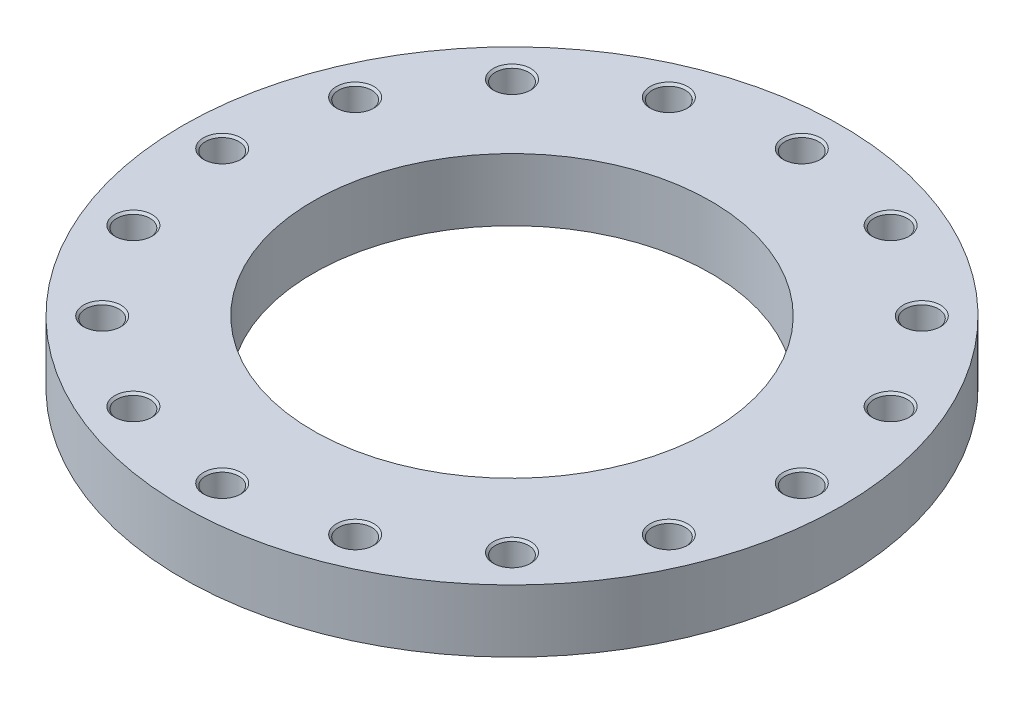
ISO-10303-21;
HEADER;
FILE_DESCRIPTION(('STEP AP214'),'2;1');
FILE_NAME('part.step','',(''),(''),'','','');
FILE_SCHEMA(('AUTOMOTIVE_DESIGN { 1 0 10303 214 1 1 1 1 }'));
ENDSEC;
DATA;
#1=APPLICATION_CONTEXT('core data for automotive mechanical design processes');
#2=APPLICATION_PROTOCOL_DEFINITION('international standard','automotive_design',2000,#1);
#3=PRODUCT_CONTEXT('',#1,'mechanical');
#4=PRODUCT('Part','Part','',(#3));
#5=PRODUCT_RELATED_PRODUCT_CATEGORY('part','',(#4));
#6=PRODUCT_DEFINITION_FORMATION('','',#4);
#7=PRODUCT_DEFINITION_CONTEXT('part definition',#1,'design');
#8=PRODUCT_DEFINITION('design','',#6,#7);
#9=PRODUCT_DEFINITION_SHAPE('','',#8);
#10=(LENGTH_UNIT() NAMED_UNIT(*) SI_UNIT(.MILLI.,.METRE.));
#11=(NAMED_UNIT(*) PLANE_ANGLE_UNIT() SI_UNIT($,.RADIAN.));
#12=(NAMED_UNIT(*) SI_UNIT($,.STERADIAN.) SOLID_ANGLE_UNIT());
#13=UNCERTAINTY_MEASURE_WITH_UNIT(LENGTH_MEASURE(1.E-05),#10,'distance_accuracy_value','');
#14=(GEOMETRIC_REPRESENTATION_CONTEXT(3) GLOBAL_UNCERTAINTY_ASSIGNED_CONTEXT((#13)) GLOBAL_UNIT_ASSIGNED_CONTEXT((#10,
#11,#12)) REPRESENTATION_CONTEXT('',''));
#15=CARTESIAN_POINT('',(0.,0.,0.));
#16=DIRECTION('',(0.,0.,1.));
#17=DIRECTION('',(1.,0.,0.));
#18=AXIS2_PLACEMENT_3D('',#15,#16,#17);
#19=CARTESIAN_POINT('',(0.,27.5,0.));
#20=DIRECTION('',(0.,-1.,0.));
#21=DIRECTION('',(1.,0.,0.));
#22=AXIS2_PLACEMENT_3D('',#19,#20,#21);
#23=CYLINDRICAL_SURFACE('',#22,290.);
#24=CARTESIAN_POINT('',(0.,0.,0.));
#25=DIRECTION('',(0.,1.,0.));
#26=DIRECTION('',(1.,0.,0.));
#27=AXIS2_PLACEMENT_3D('',#24,#25,#26);
#28=CIRCLE('',#27,290.);
#29=CARTESIAN_POINT('',(290.,0.,0.));
#30=VERTEX_POINT('',#29);
#31=EDGE_CURVE('E9',#30,#30,#28,.T.);
#32=ORIENTED_EDGE('',*,*,#31,.T.);
#33=EDGE_LOOP('',(#32));
#34=FACE_BOUND('',#33,.T.);
#35=CARTESIAN_POINT('',(0.,55.,0.));
#36=DIRECTION('',(0.,1.,0.));
#37=DIRECTION('',(1.,0.,0.));
#38=AXIS2_PLACEMENT_3D('',#35,#36,#37);
#39=CIRCLE('',#38,290.);
#40=CARTESIAN_POINT('',(290.,55.,0.));
#41=VERTEX_POINT('',#40);
#42=EDGE_CURVE('E331',#41,#41,#39,.T.);
#43=ORIENTED_EDGE('',*,*,#42,.F.);
#44=EDGE_LOOP('',(#43));
#45=FACE_BOUND('',#44,.T.);
#46=ADVANCED_FACE('F15',(#34,#45),#23,.T.);
#47=CARTESIAN_POINT('',(232.5,0.,0.));
#48=DIRECTION('',(0.,-1.,0.));
#49=DIRECTION('',(-1.,0.,0.));
#50=AXIS2_PLACEMENT_3D('',#47,#48,#49);
#51=PLANE('',#50);
#52=CARTESIAN_POINT('',(0.,0.,0.));
#53=DIRECTION('',(0.,1.,0.));
#54=DIRECTION('',(1.,0.,0.));
#55=AXIS2_PLACEMENT_3D('',#52,#53,#54);
#56=CIRCLE('',#55,175.);
#57=CARTESIAN_POINT('',(175.,0.,0.));
#58=VERTEX_POINT('',#57);
#59=EDGE_CURVE('E23',#58,#58,#56,.T.);
#60=ORIENTED_EDGE('',*,*,#59,.T.);
#61=EDGE_LOOP('',(#60));
#62=FACE_BOUND('',#61,.T.);
#63=ORIENTED_EDGE('',*,*,#31,.F.);
#64=EDGE_LOOP('',(#63));
#65=FACE_BOUND('',#64,.T.);
#66=ADVANCED_FACE('F601',(#62,#65),#51,.T.);
#67=CARTESIAN_POINT('',(0.,27.5,0.));
#68=DIRECTION('',(0.,-1.,0.));
#69=DIRECTION('',(1.,0.,0.));
#70=AXIS2_PLACEMENT_3D('',#67,#68,#69);
#71=CYLINDRICAL_SURFACE('',#70,175.);
#72=CARTESIAN_POINT('',(0.,55.,0.));
#73=DIRECTION('',(0.,1.,0.));
#74=DIRECTION('',(1.,0.,0.));
#75=AXIS2_PLACEMENT_3D('',#72,#73,#74);
#76=CIRCLE('',#75,175.);
#77=CARTESIAN_POINT('',(175.,55.,0.));
#78=VERTEX_POINT('',#77);
#79=EDGE_CURVE('E335',#78,#78,#76,.T.);
#80=ORIENTED_EDGE('',*,*,#79,.T.);
#81=EDGE_LOOP('',(#80));
#82=FACE_BOUND('',#81,.T.);
#83=ORIENTED_EDGE('',*,*,#59,.F.);
#84=EDGE_LOOP('',(#83));
#85=FACE_BOUND('',#84,.T.);
#86=ADVANCED_FACE('F605',(#82,#85),#71,.F.);
#87=CARTESIAN_POINT('',(232.5,55.,0.));
#88=DIRECTION('',(0.,1.,0.));
#89=DIRECTION('',(1.,0.,0.));
#90=AXIS2_PLACEMENT_3D('',#87,#88,#89);
#91=PLANE('',#90);
#92=ORIENTED_EDGE('',*,*,#42,.T.);
#93=EDGE_LOOP('',(#92));
#94=FACE_BOUND('',#93,.T.);
#95=ORIENTED_EDGE('',*,*,#79,.F.);
#96=EDGE_LOOP('',(#95));
#97=FACE_BOUND('',#96,.T.);
#98=CARTESIAN_POINT('',(255.,55.,0.));
#99=DIRECTION('',(0.,-1.,0.));
#100=DIRECTION('',(1.,0.,0.));
#101=AXIS2_PLACEMENT_3D('',#98,#99,#100);
#102=CIRCLE('',#101,16.5);
#103=CARTESIAN_POINT('',(271.5,55.,0.));
#104=VERTEX_POINT('',#103);
#105=EDGE_CURVE('E344',#104,#104,#102,.T.);
#106=ORIENTED_EDGE('',*,*,#105,.T.);
#107=EDGE_LOOP('',(#106));
#108=FACE_BOUND('',#107,.T.);
#109=CARTESIAN_POINT('',(235.589280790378,55.,-97.5842752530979));
#110=DIRECTION('',(0.,-1.,0.));
#111=DIRECTION('',(0.923879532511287,0.,-0.38268343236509));
#112=AXIS2_PLACEMENT_3D('',#109,#110,#111);
#113=CIRCLE('',#112,16.5);
#114=CARTESIAN_POINT('',(250.833293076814,55.,-103.898551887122));
#115=VERTEX_POINT('',#114);
#116=EDGE_CURVE('E346',#115,#115,#113,.T.);
#117=ORIENTED_EDGE('',*,*,#116,.T.);
#118=EDGE_LOOP('',(#117));
#119=FACE_BOUND('',#118,.T.);
#120=CARTESIAN_POINT('',(180.31222920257,55.,-180.31222920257));
#121=DIRECTION('',(0.,-1.,0.));
#122=DIRECTION('',(0.707106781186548,0.,-0.707106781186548));
#123=AXIS2_PLACEMENT_3D('',#120,#121,#122);
#124=CIRCLE('',#123,16.5);
#125=CARTESIAN_POINT('',(191.979491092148,55.,-191.979491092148));
#126=VERTEX_POINT('',#125);
#127=EDGE_CURVE('E355',#126,#126,#124,.T.);
#128=ORIENTED_EDGE('',*,*,#127,.T.);
#129=EDGE_LOOP('',(#128));
#130=FACE_BOUND('',#129,.T.);
#131=CARTESIAN_POINT('',(97.5842752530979,55.,-235.589280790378));
#132=DIRECTION('',(0.,-1.,0.));
#133=DIRECTION('',(0.38268343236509,0.,-0.923879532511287));
#134=AXIS2_PLACEMENT_3D('',#131,#132,#133);
#135=CIRCLE('',#134,16.5);
#136=CARTESIAN_POINT('',(103.898551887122,55.,-250.833293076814));
#137=VERTEX_POINT('',#136);
#138=EDGE_CURVE('E365',#137,#137,#135,.T.);
#139=ORIENTED_EDGE('',*,*,#138,.T.);
#140=EDGE_LOOP('',(#139));
#141=FACE_BOUND('',#140,.T.);
#142=CARTESIAN_POINT('',(0.,55.,-255.));
#143=DIRECTION('',(0.,-1.,0.));
#144=DIRECTION('',(0.,0.,-1.));
#145=AXIS2_PLACEMENT_3D('',#142,#143,#144);
#146=CIRCLE('',#145,16.5);
#147=CARTESIAN_POINT('',(0.,55.,-271.5));
#148=VERTEX_POINT('',#147);
#149=EDGE_CURVE('E367',#148,#148,#146,.T.);
#150=ORIENTED_EDGE('',*,*,#149,.T.);
#151=EDGE_LOOP('',(#150));
#152=FACE_BOUND('',#151,.T.);
#153=CARTESIAN_POINT('',(-97.5842752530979,55.,-235.589280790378));
#154=DIRECTION('',(0.,-1.,0.));
#155=DIRECTION('',(-0.38268343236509,0.,-0.923879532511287));
#156=AXIS2_PLACEMENT_3D('',#153,#154,#155);
#157=CIRCLE('',#156,16.5);
#158=CARTESIAN_POINT('',(-103.898551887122,55.,-250.833293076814));
#159=VERTEX_POINT('',#158);
#160=EDGE_CURVE('E382',#159,#159,#157,.T.);
#161=ORIENTED_EDGE('',*,*,#160,.T.);
#162=EDGE_LOOP('',(#161));
#163=FACE_BOUND('',#162,.T.);
#164=CARTESIAN_POINT('',(-180.31222920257,55.,-180.31222920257));
#165=DIRECTION('',(0.,-1.,0.));
#166=DIRECTION('',(-0.707106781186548,0.,-0.707106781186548));
#167=AXIS2_PLACEMENT_3D('',#164,#165,#166);
#168=CIRCLE('',#167,16.5);
#169=CARTESIAN_POINT('',(-191.979491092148,55.,-191.979491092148));
#170=VERTEX_POINT('',#169);
#171=EDGE_CURVE('E400',#170,#170,#168,.T.);
#172=ORIENTED_EDGE('',*,*,#171,.T.);
#173=EDGE_LOOP('',(#172));
#174=FACE_BOUND('',#173,.T.);
#175=CARTESIAN_POINT('',(-235.589280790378,55.,-97.5842752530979));
#176=DIRECTION('',(0.,-1.,0.));
#177=DIRECTION('',(-0.923879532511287,0.,-0.38268343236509));
#178=AXIS2_PLACEMENT_3D('',#175,#176,#177);
#179=CIRCLE('',#178,16.5);
#180=CARTESIAN_POINT('',(-250.833293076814,55.,-103.898551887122));
#181=VERTEX_POINT('',#180);
#182=EDGE_CURVE('E414',#181,#181,#179,.T.);
#183=ORIENTED_EDGE('',*,*,#182,.T.);
#184=EDGE_LOOP('',(#183));
#185=FACE_BOUND('',#184,.T.);
#186=CARTESIAN_POINT('',(-255.,55.,0.));
#187=DIRECTION('',(0.,-1.,0.));
#188=DIRECTION('',(-1.,0.,0.));
#189=AXIS2_PLACEMENT_3D('',#186,#187,#188);
#190=CIRCLE('',#189,16.5);
#191=CARTESIAN_POINT('',(-271.5,55.,0.));
#192=VERTEX_POINT('',#191);
#193=EDGE_CURVE('E427',#192,#192,#190,.T.);
#194=ORIENTED_EDGE('',*,*,#193,.T.);
#195=EDGE_LOOP('',(#194));
#196=FACE_BOUND('',#195,.T.);
#197=CARTESIAN_POINT('',(-235.589280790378,55.,97.5842752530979));
#198=DIRECTION('',(0.,-1.,0.));
#199=DIRECTION('',(-0.923879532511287,0.,0.38268343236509));
#200=AXIS2_PLACEMENT_3D('',#197,#198,#199);
#201=CIRCLE('',#200,16.5);
#202=CARTESIAN_POINT('',(-250.833293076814,55.,103.898551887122));
#203=VERTEX_POINT('',#202);
#204=EDGE_CURVE('E437',#203,#203,#201,.T.);
#205=ORIENTED_EDGE('',*,*,#204,.T.);
#206=EDGE_LOOP('',(#205));
#207=FACE_BOUND('',#206,.T.);
#208=CARTESIAN_POINT('',(-180.31222920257,55.,180.31222920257));
#209=DIRECTION('',(0.,-1.,0.));
#210=DIRECTION('',(-0.707106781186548,0.,0.707106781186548));
#211=AXIS2_PLACEMENT_3D('',#208,#209,#210);
#212=CIRCLE('',#211,16.5);
#213=CARTESIAN_POINT('',(-191.979491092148,55.,191.979491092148));
#214=VERTEX_POINT('',#213);
#215=EDGE_CURVE('E452',#214,#214,#212,.T.);
#216=ORIENTED_EDGE('',*,*,#215,.T.);
#217=EDGE_LOOP('',(#216));
#218=FACE_BOUND('',#217,.T.);
#219=CARTESIAN_POINT('',(-97.584275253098,55.,235.589280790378));
#220=DIRECTION('',(0.,-1.,0.));
#221=DIRECTION('',(-0.382683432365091,0.,0.923879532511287));
#222=AXIS2_PLACEMENT_3D('',#219,#220,#221);
#223=CIRCLE('',#222,16.5);
#224=CARTESIAN_POINT('',(-103.898551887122,55.,250.833293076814));
#225=VERTEX_POINT('',#224);
#226=EDGE_CURVE('E469',#225,#225,#223,.T.);
#227=ORIENTED_EDGE('',*,*,#226,.T.);
#228=EDGE_LOOP('',(#227));
#229=FACE_BOUND('',#228,.T.);
#230=CARTESIAN_POINT('',(0.,55.,255.));
#231=DIRECTION('',(0.,-1.,0.));
#232=DIRECTION('',(0.,0.,1.));
#233=AXIS2_PLACEMENT_3D('',#230,#231,#232);
#234=CIRCLE('',#233,16.5);
#235=CARTESIAN_POINT('',(0.,55.,271.5));
#236=VERTEX_POINT('',#235);
#237=EDGE_CURVE('E484',#236,#236,#234,.T.);
#238=ORIENTED_EDGE('',*,*,#237,.T.);
#239=EDGE_LOOP('',(#238));
#240=FACE_BOUND('',#239,.T.);
#241=CARTESIAN_POINT('',(97.5842752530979,55.,235.589280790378));
#242=DIRECTION('',(0.,-1.,0.));
#243=DIRECTION('',(0.38268343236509,0.,0.923879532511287));
#244=AXIS2_PLACEMENT_3D('',#241,#242,#243);
#245=CIRCLE('',#244,16.5);
#246=CARTESIAN_POINT('',(103.898551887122,55.,250.833293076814));
#247=VERTEX_POINT('',#246);
#248=EDGE_CURVE('E501',#247,#247,#245,.T.);
#249=ORIENTED_EDGE('',*,*,#248,.T.);
#250=EDGE_LOOP('',(#249));
#251=FACE_BOUND('',#250,.T.);
#252=CARTESIAN_POINT('',(180.31222920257,55.,180.31222920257));
#253=DIRECTION('',(0.,-1.,0.));
#254=DIRECTION('',(0.707106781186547,0.,0.707106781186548));
#255=AXIS2_PLACEMENT_3D('',#252,#253,#254);
#256=CIRCLE('',#255,16.5);
#257=CARTESIAN_POINT('',(191.979491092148,55.,191.979491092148));
#258=VERTEX_POINT('',#257);
#259=EDGE_CURVE('E512',#258,#258,#256,.T.);
#260=ORIENTED_EDGE('',*,*,#259,.T.);
#261=EDGE_LOOP('',(#260));
#262=FACE_BOUND('',#261,.T.);
#263=CARTESIAN_POINT('',(235.589280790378,55.,97.5842752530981));
#264=DIRECTION('',(0.,-1.,0.));
#265=DIRECTION('',(0.923879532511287,0.,0.382683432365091));
#266=AXIS2_PLACEMENT_3D('',#263,#264,#265);
#267=CIRCLE('',#266,16.5);
#268=CARTESIAN_POINT('',(250.833293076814,55.,103.898551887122));
#269=VERTEX_POINT('',#268);
#270=EDGE_CURVE('E527',#269,#269,#267,.T.);
#271=ORIENTED_EDGE('',*,*,#270,.T.);
#272=EDGE_LOOP('',(#271));
#273=FACE_BOUND('',#272,.T.);
#274=ADVANCED_FACE('F332',(#94,#97,#108,#119,#130,#141,#152,#163,#174,#185,#196,#207,#218,#229,
#240,#251,#262,#273),#91,.T.);
#275=CARTESIAN_POINT('',(255.,7.78371923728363,0.));
#276=DIRECTION('',(0.,1.,0.));
#277=DIRECTION('',(1.,0.,0.));
#278=AXIS2_PLACEMENT_3D('',#275,#276,#277);
#279=CONICAL_SURFACE('',#278,7.3028125,1.0471975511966);
#280=CARTESIAN_POINT('',(255.,12.,0.));
#281=DIRECTION('',(0.,-1.,0.));
#282=DIRECTION('',(1.,0.,0.));
#283=AXIS2_PLACEMENT_3D('',#280,#281,#282);
#284=CIRCLE('',#283,14.605625);
#285=CARTESIAN_POINT('',(269.605625,12.,0.));
#286=VERTEX_POINT('',#285);
#287=EDGE_CURVE('E337',#286,#286,#284,.T.);
#288=ORIENTED_EDGE('',*,*,#287,.F.);
#289=EDGE_LOOP('',(#288));
#290=FACE_BOUND('',#289,.T.);
#291=CARTESIAN_POINT('',(255.,3.56743847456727,0.));
#292=VERTEX_POINT('',#291);
#293=VERTEX_LOOP('',#292);
#294=FACE_BOUND('',#293,.T.);
#295=ADVANCED_FACE('F685',(#290,#294),#279,.F.);
#296=CARTESIAN_POINT('',(255.,16.5528125,0.));
#297=DIRECTION('',(0.,1.,0.));
#298=DIRECTION('',(1.,0.,0.));
#299=AXIS2_PLACEMENT_3D('',#296,#297,#298);
#300=CYLINDRICAL_SURFACE('',#299,14.605625);
#301=CARTESIAN_POINT('',(255.,21.105625,0.));
#302=DIRECTION('',(0.,-1.,0.));
#303=DIRECTION('',(1.,0.,0.));
#304=AXIS2_PLACEMENT_3D('',#301,#302,#303);
#305=CIRCLE('',#304,14.605625);
#306=CARTESIAN_POINT('',(269.605625,21.105625,0.));
#307=VERTEX_POINT('',#306);
#308=EDGE_CURVE('E341',#307,#307,#305,.T.);
#309=ORIENTED_EDGE('',*,*,#308,.F.);
#310=EDGE_LOOP('',(#309));
#311=FACE_BOUND('',#310,.T.);
#312=ORIENTED_EDGE('',*,*,#287,.T.);
#313=EDGE_LOOP('',(#312));
#314=FACE_BOUND('',#313,.T.);
#315=ADVANCED_FACE('F681',(#311,#314),#300,.F.);
#316=CARTESIAN_POINT('',(255.,22.0528125,0.));
#317=DIRECTION('',(0.,1.,0.));
#318=DIRECTION('',(1.,0.,0.));
#319=AXIS2_PLACEMENT_3D('',#316,#317,#318);
#320=CONICAL_SURFACE('',#319,15.5528125,0.785398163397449);
#321=CARTESIAN_POINT('',(255.,23.,0.));
#322=DIRECTION('',(0.,-1.,0.));
#323=DIRECTION('',(1.,0.,0.));
#324=AXIS2_PLACEMENT_3D('',#321,#322,#323);
#325=CIRCLE('',#324,16.5);
#326=CARTESIAN_POINT('',(271.5,23.,0.));
#327=VERTEX_POINT('',#326);
#328=EDGE_CURVE('E371',#327,#327,#325,.T.);
#329=ORIENTED_EDGE('',*,*,#328,.F.);
#330=EDGE_LOOP('',(#329));
#331=FACE_BOUND('',#330,.T.);
#332=ORIENTED_EDGE('',*,*,#308,.T.);
#333=EDGE_LOOP('',(#332));
#334=FACE_BOUND('',#333,.T.);
#335=ADVANCED_FACE('F677',(#331,#334),#320,.F.);
#336=CARTESIAN_POINT('',(270.5528125,23.,0.));
#337=DIRECTION('',(0.,1.,0.));
#338=DIRECTION('',(-1.,0.,0.));
#339=AXIS2_PLACEMENT_3D('',#336,#337,#338);
#340=PLANE('',#339);
#341=CARTESIAN_POINT('',(255.,23.,0.));
#342=DIRECTION('',(0.,-1.,0.));
#343=DIRECTION('',(1.,0.,0.));
#344=AXIS2_PLACEMENT_3D('',#341,#342,#343);
#345=CIRCLE('',#344,14.605625);
#346=CARTESIAN_POINT('',(269.605625,23.,0.));
#347=VERTEX_POINT('',#346);
#348=EDGE_CURVE('E373',#347,#347,#345,.T.);
#349=ORIENTED_EDGE('',*,*,#348,.F.);
#350=EDGE_LOOP('',(#349));
#351=FACE_BOUND('',#350,.T.);
#352=ORIENTED_EDGE('',*,*,#328,.T.);
#353=EDGE_LOOP('',(#352));
#354=FACE_BOUND('',#353,.T.);
#355=ADVANCED_FACE('F680',(#351,#354),#340,.F.);
#356=CARTESIAN_POINT('',(255.,38.0528125,0.));
#357=DIRECTION('',(0.,1.,0.));
#358=DIRECTION('',(1.,0.,0.));
#359=AXIS2_PLACEMENT_3D('',#356,#357,#358);
#360=CYLINDRICAL_SURFACE('',#359,14.605625);
#361=CARTESIAN_POINT('',(255.,53.105625,0.));
#362=DIRECTION('',(0.,-1.,0.));
#363=DIRECTION('',(1.,0.,0.));
#364=AXIS2_PLACEMENT_3D('',#361,#362,#363);
#365=CIRCLE('',#364,14.605625);
#366=CARTESIAN_POINT('',(269.605625,53.105625,0.));
#367=VERTEX_POINT('',#366);
#368=EDGE_CURVE('E342',#367,#367,#365,.T.);
#369=ORIENTED_EDGE('',*,*,#368,.F.);
#370=EDGE_LOOP('',(#369));
#371=FACE_BOUND('',#370,.T.);
#372=ORIENTED_EDGE('',*,*,#348,.T.);
#373=EDGE_LOOP('',(#372));
#374=FACE_BOUND('',#373,.T.);
#375=ADVANCED_FACE('F760',(#371,#374),#360,.F.);
#376=CARTESIAN_POINT('',(255.,54.0528125,0.));
#377=DIRECTION('',(0.,1.,0.));
#378=DIRECTION('',(1.,0.,0.));
#379=AXIS2_PLACEMENT_3D('',#376,#377,#378);
#380=CONICAL_SURFACE('',#379,15.5528125,0.785398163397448);
#381=ORIENTED_EDGE('',*,*,#105,.F.);
#382=EDGE_LOOP('',(#381));
#383=FACE_BOUND('',#382,.T.);
#384=ORIENTED_EDGE('',*,*,#368,.T.);
#385=EDGE_LOOP('',(#384));
#386=FACE_BOUND('',#385,.T.);
#387=ADVANCED_FACE('F675',(#383,#386),#380,.F.);
#388=CARTESIAN_POINT('',(235.589280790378,7.78371923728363,-97.5842752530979));
#389=DIRECTION('',(0.,1.,0.));
#390=DIRECTION('',(0.923879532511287,0.,-0.38268343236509));
#391=AXIS2_PLACEMENT_3D('',#388,#389,#390);
#392=CONICAL_SURFACE('',#391,7.3028125,1.0471975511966);
#393=CARTESIAN_POINT('',(235.589280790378,12.,-97.5842752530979));
#394=DIRECTION('',(0.,-1.,0.));
#395=DIRECTION('',(0.923879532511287,0.,-0.38268343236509));
#396=AXIS2_PLACEMENT_3D('',#393,#394,#395);
#397=CIRCLE('',#396,14.605625);
#398=CARTESIAN_POINT('',(249.083118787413,12.,-103.173605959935));
#399=VERTEX_POINT('',#398);
#400=EDGE_CURVE('E345',#399,#399,#397,.T.);
#401=ORIENTED_EDGE('',*,*,#400,.F.);
#402=EDGE_LOOP('',(#401));
#403=FACE_BOUND('',#402,.T.);
#404=CARTESIAN_POINT('',(235.589280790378,3.56743847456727,-97.5842752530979));
#405=VERTEX_POINT('',#404);
#406=VERTEX_LOOP('',#405);
#407=FACE_BOUND('',#406,.T.);
#408=ADVANCED_FACE('F672',(#403,#407),#392,.F.);
#409=CARTESIAN_POINT('',(235.589280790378,16.5528125,-97.5842752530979));
#410=DIRECTION('',(0.,1.,0.));
#411=DIRECTION('',(0.923879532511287,0.,-0.38268343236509));
#412=AXIS2_PLACEMENT_3D('',#409,#410,#411);
#413=CYLINDRICAL_SURFACE('',#412,14.605625);
#414=CARTESIAN_POINT('',(235.589280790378,21.105625,-97.5842752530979));
#415=DIRECTION('',(0.,-1.,0.));
#416=DIRECTION('',(0.923879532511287,0.,-0.38268343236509));
#417=AXIS2_PLACEMENT_3D('',#414,#415,#416);
#418=CIRCLE('',#417,14.605625);
#419=CARTESIAN_POINT('',(249.083118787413,21.105625,-103.173605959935));
#420=VERTEX_POINT('',#419);
#421=EDGE_CURVE('E388',#420,#420,#418,.T.);
#422=ORIENTED_EDGE('',*,*,#421,.F.);
#423=EDGE_LOOP('',(#422));
#424=FACE_BOUND('',#423,.T.);
#425=ORIENTED_EDGE('',*,*,#400,.T.);
#426=EDGE_LOOP('',(#425));
#427=FACE_BOUND('',#426,.T.);
#428=ADVANCED_FACE('F627',(#424,#427),#413,.F.);
#429=CARTESIAN_POINT('',(235.589280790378,22.0528125,-97.5842752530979));
#430=DIRECTION('',(0.,1.,0.));
#431=DIRECTION('',(0.923879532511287,0.,-0.38268343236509));
#432=AXIS2_PLACEMENT_3D('',#429,#430,#431);
#433=CONICAL_SURFACE('',#432,15.5528125,0.785398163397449);
#434=CARTESIAN_POINT('',(235.589280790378,23.,-97.5842752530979));
#435=DIRECTION('',(0.,-1.,0.));
#436=DIRECTION('',(0.923879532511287,0.,-0.38268343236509));
#437=AXIS2_PLACEMENT_3D('',#434,#435,#436);
#438=CIRCLE('',#437,16.5);
#439=CARTESIAN_POINT('',(250.833293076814,23.,-103.898551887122));
#440=VERTEX_POINT('',#439);
#441=EDGE_CURVE('E450',#440,#440,#438,.T.);
#442=ORIENTED_EDGE('',*,*,#441,.F.);
#443=EDGE_LOOP('',(#442));
#444=FACE_BOUND('',#443,.T.);
#445=ORIENTED_EDGE('',*,*,#421,.T.);
#446=EDGE_LOOP('',(#445));
#447=FACE_BOUND('',#446,.T.);
#448=ADVANCED_FACE('F623',(#444,#447),#433,.F.);
#449=CARTESIAN_POINT('',(249.958205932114,23.,-103.536078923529));
#450=DIRECTION('',(0.,1.,0.));
#451=DIRECTION('',(-0.923879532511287,0.,0.38268343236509));
#452=AXIS2_PLACEMENT_3D('',#449,#450,#451);
#453=PLANE('',#452);
#454=CARTESIAN_POINT('',(235.589280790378,23.,-97.5842752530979));
#455=DIRECTION('',(0.,-1.,0.));
#456=DIRECTION('',(0.923879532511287,0.,-0.38268343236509));
#457=AXIS2_PLACEMENT_3D('',#454,#455,#456);
#458=CIRCLE('',#457,14.605625);
#459=CARTESIAN_POINT('',(249.083118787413,23.,-103.173605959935));
#460=VERTEX_POINT('',#459);
#461=EDGE_CURVE('E348',#460,#460,#458,.T.);
#462=ORIENTED_EDGE('',*,*,#461,.F.);
#463=EDGE_LOOP('',(#462));
#464=FACE_BOUND('',#463,.T.);
#465=ORIENTED_EDGE('',*,*,#441,.T.);
#466=EDGE_LOOP('',(#465));
#467=FACE_BOUND('',#466,.T.);
#468=ADVANCED_FACE('F626',(#464,#467),#453,.F.);
#469=CARTESIAN_POINT('',(235.589280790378,38.0528125,-97.5842752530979));
#470=DIRECTION('',(0.,1.,0.));
#471=DIRECTION('',(0.923879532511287,0.,-0.38268343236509));
#472=AXIS2_PLACEMENT_3D('',#469,#470,#471);
#473=CYLINDRICAL_SURFACE('',#472,14.605625);
#474=CARTESIAN_POINT('',(235.589280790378,53.105625,-97.5842752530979));
#475=DIRECTION('',(0.,-1.,0.));
#476=DIRECTION('',(0.923879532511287,0.,-0.38268343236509));
#477=AXIS2_PLACEMENT_3D('',#474,#475,#476);
#478=CIRCLE('',#477,14.605625);
#479=CARTESIAN_POINT('',(249.083118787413,53.105625,-103.173605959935));
#480=VERTEX_POINT('',#479);
#481=EDGE_CURVE('E349',#480,#480,#478,.T.);
#482=ORIENTED_EDGE('',*,*,#481,.F.);
#483=EDGE_LOOP('',(#482));
#484=FACE_BOUND('',#483,.T.);
#485=ORIENTED_EDGE('',*,*,#461,.T.);
#486=EDGE_LOOP('',(#485));
#487=FACE_BOUND('',#486,.T.);
#488=ADVANCED_FACE('F667',(#484,#487),#473,.F.);
#489=CARTESIAN_POINT('',(235.589280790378,54.0528125,-97.5842752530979));
#490=DIRECTION('',(0.,1.,0.));
#491=DIRECTION('',(0.923879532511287,0.,-0.38268343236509));
#492=AXIS2_PLACEMENT_3D('',#489,#490,#491);
#493=CONICAL_SURFACE('',#492,15.5528125,0.785398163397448);
#494=ORIENTED_EDGE('',*,*,#116,.F.);
#495=EDGE_LOOP('',(#494));
#496=FACE_BOUND('',#495,.T.);
#497=ORIENTED_EDGE('',*,*,#481,.T.);
#498=EDGE_LOOP('',(#497));
#499=FACE_BOUND('',#498,.T.);
#500=ADVANCED_FACE('F663',(#496,#499),#493,.F.);
#501=CARTESIAN_POINT('',(180.31222920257,7.78371923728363,-180.31222920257));
#502=DIRECTION('',(0.,1.,0.));
#503=DIRECTION('',(0.707106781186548,0.,-0.707106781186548));
#504=AXIS2_PLACEMENT_3D('',#501,#502,#503);
#505=CONICAL_SURFACE('',#504,7.3028125,1.0471975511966);
#506=CARTESIAN_POINT('',(180.31222920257,12.,-180.31222920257));
#507=DIRECTION('',(0.,-1.,0.));
#508=DIRECTION('',(0.707106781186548,0.,-0.707106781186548));
#509=AXIS2_PLACEMENT_3D('',#506,#507,#508);
#510=CIRCLE('',#509,14.605625);
#511=CARTESIAN_POINT('',(190.639965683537,12.,-190.639965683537));
#512=VERTEX_POINT('',#511);
#513=EDGE_CURVE('E351',#512,#512,#510,.T.);
#514=ORIENTED_EDGE('',*,*,#513,.F.);
#515=EDGE_LOOP('',(#514));
#516=FACE_BOUND('',#515,.T.);
#517=CARTESIAN_POINT('',(180.31222920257,3.56743847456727,-180.31222920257));
#518=VERTEX_POINT('',#517);
#519=VERTEX_LOOP('',#518);
#520=FACE_BOUND('',#519,.T.);
#521=ADVANCED_FACE('F666',(#516,#520),#505,.F.);
#522=CARTESIAN_POINT('',(180.31222920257,16.5528125,-180.31222920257));
#523=DIRECTION('',(0.,1.,0.));
#524=DIRECTION('',(0.707106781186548,0.,-0.707106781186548));
#525=AXIS2_PLACEMENT_3D('',#522,#523,#524);
#526=CYLINDRICAL_SURFACE('',#525,14.605625);
#527=CARTESIAN_POINT('',(180.31222920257,21.105625,-180.31222920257));
#528=DIRECTION('',(0.,-1.,0.));
#529=DIRECTION('',(0.707106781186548,0.,-0.707106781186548));
#530=AXIS2_PLACEMENT_3D('',#527,#528,#529);
#531=CIRCLE('',#530,14.605625);
#532=CARTESIAN_POINT('',(190.639965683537,21.105625,-190.639965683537));
#533=VERTEX_POINT('',#532);
#534=EDGE_CURVE('E383',#533,#533,#531,.T.);
#535=ORIENTED_EDGE('',*,*,#534,.F.);
#536=EDGE_LOOP('',(#535));
#537=FACE_BOUND('',#536,.T.);
#538=ORIENTED_EDGE('',*,*,#513,.T.);
#539=EDGE_LOOP('',(#538));
#540=FACE_BOUND('',#539,.T.);
#541=ADVANCED_FACE('F768',(#537,#540),#526,.F.);
#542=CARTESIAN_POINT('',(180.31222920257,22.0528125,-180.31222920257));
#543=DIRECTION('',(0.,1.,0.));
#544=DIRECTION('',(0.707106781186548,0.,-0.707106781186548));
#545=AXIS2_PLACEMENT_3D('',#542,#543,#544);
#546=CONICAL_SURFACE('',#545,15.5528125,0.785398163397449);
#547=CARTESIAN_POINT('',(180.31222920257,23.,-180.31222920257));
#548=DIRECTION('',(0.,-1.,0.));
#549=DIRECTION('',(0.707106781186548,0.,-0.707106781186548));
#550=AXIS2_PLACEMENT_3D('',#547,#548,#549);
#551=CIRCLE('',#550,16.5);
#552=CARTESIAN_POINT('',(191.979491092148,23.,-191.979491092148));
#553=VERTEX_POINT('',#552);
#554=EDGE_CURVE('E354',#553,#553,#551,.T.);
#555=ORIENTED_EDGE('',*,*,#554,.F.);
#556=EDGE_LOOP('',(#555));
#557=FACE_BOUND('',#556,.T.);
#558=ORIENTED_EDGE('',*,*,#534,.T.);
#559=EDGE_LOOP('',(#558));
#560=FACE_BOUND('',#559,.T.);
#561=ADVANCED_FACE('F719',(#557,#560),#546,.F.);
#562=CARTESIAN_POINT('',(191.309728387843,23.,-191.309728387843));
#563=DIRECTION('',(0.,1.,0.));
#564=DIRECTION('',(-0.707106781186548,0.,0.707106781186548));
#565=AXIS2_PLACEMENT_3D('',#562,#563,#564);
#566=PLANE('',#565);
#567=CARTESIAN_POINT('',(180.31222920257,23.,-180.31222920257));
#568=DIRECTION('',(0.,-1.,0.));
#569=DIRECTION('',(0.707106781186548,0.,-0.707106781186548));
#570=AXIS2_PLACEMENT_3D('',#567,#568,#569);
#571=CIRCLE('',#570,14.605625);
#572=CARTESIAN_POINT('',(190.639965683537,23.,-190.639965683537));
#573=VERTEX_POINT('',#572);
#574=EDGE_CURVE('E352',#573,#573,#571,.T.);
#575=ORIENTED_EDGE('',*,*,#574,.F.);
#576=EDGE_LOOP('',(#575));
#577=FACE_BOUND('',#576,.T.);
#578=ORIENTED_EDGE('',*,*,#554,.T.);
#579=EDGE_LOOP('',(#578));
#580=FACE_BOUND('',#579,.T.);
#581=ADVANCED_FACE('F661',(#577,#580),#566,.F.);
#582=CARTESIAN_POINT('',(180.31222920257,38.0528125,-180.31222920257));
#583=DIRECTION('',(0.,1.,0.));
#584=DIRECTION('',(0.707106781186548,0.,-0.707106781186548));
#585=AXIS2_PLACEMENT_3D('',#582,#583,#584);
#586=CYLINDRICAL_SURFACE('',#585,14.605625);
#587=CARTESIAN_POINT('',(180.31222920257,53.105625,-180.31222920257));
#588=DIRECTION('',(0.,-1.,0.));
#589=DIRECTION('',(0.707106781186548,0.,-0.707106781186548));
#590=AXIS2_PLACEMENT_3D('',#587,#588,#589);
#591=CIRCLE('',#590,14.605625);
#592=CARTESIAN_POINT('',(190.639965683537,53.105625,-190.639965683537));
#593=VERTEX_POINT('',#592);
#594=EDGE_CURVE('E356',#593,#593,#591,.T.);
#595=ORIENTED_EDGE('',*,*,#594,.F.);
#596=EDGE_LOOP('',(#595));
#597=FACE_BOUND('',#596,.T.);
#598=ORIENTED_EDGE('',*,*,#574,.T.);
#599=EDGE_LOOP('',(#598));
#600=FACE_BOUND('',#599,.T.);
#601=ADVANCED_FACE('F657',(#597,#600),#586,.F.);
#602=CARTESIAN_POINT('',(180.31222920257,54.0528125,-180.31222920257));
#603=DIRECTION('',(0.,1.,0.));
#604=DIRECTION('',(0.707106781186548,0.,-0.707106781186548));
#605=AXIS2_PLACEMENT_3D('',#602,#603,#604);
#606=CONICAL_SURFACE('',#605,15.5528125,0.785398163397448);
#607=ORIENTED_EDGE('',*,*,#127,.F.);
#608=EDGE_LOOP('',(#607));
#609=FACE_BOUND('',#608,.T.);
#610=ORIENTED_EDGE('',*,*,#594,.T.);
#611=EDGE_LOOP('',(#610));
#612=FACE_BOUND('',#611,.T.);
#613=ADVANCED_FACE('F660',(#609,#612),#606,.F.);
#614=CARTESIAN_POINT('',(97.5842752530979,7.78371923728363,-235.589280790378));
#615=DIRECTION('',(0.,1.,0.));
#616=DIRECTION('',(0.38268343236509,0.,-0.923879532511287));
#617=AXIS2_PLACEMENT_3D('',#614,#615,#616);
#618=CONICAL_SURFACE('',#617,7.3028125,1.0471975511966);
#619=CARTESIAN_POINT('',(97.5842752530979,12.,-235.589280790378));
#620=DIRECTION('',(0.,-1.,0.));
#621=DIRECTION('',(0.38268343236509,0.,-0.923879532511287));
#622=AXIS2_PLACEMENT_3D('',#619,#620,#621);
#623=CIRCLE('',#622,14.605625);
#624=CARTESIAN_POINT('',(103.173605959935,12.,-249.083118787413));
#625=VERTEX_POINT('',#624);
#626=EDGE_CURVE('E358',#625,#625,#623,.T.);
#627=ORIENTED_EDGE('',*,*,#626,.F.);
#628=EDGE_LOOP('',(#627));
#629=FACE_BOUND('',#628,.T.);
#630=CARTESIAN_POINT('',(97.5842752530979,3.56743847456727,-235.589280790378));
#631=VERTEX_POINT('',#630);
#632=VERTEX_LOOP('',#631);
#633=FACE_BOUND('',#632,.T.);
#634=ADVANCED_FACE('F655',(#629,#633),#618,.F.);
#635=CARTESIAN_POINT('',(97.5842752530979,16.5528125,-235.589280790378));
#636=DIRECTION('',(0.,1.,0.));
#637=DIRECTION('',(0.38268343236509,0.,-0.923879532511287));
#638=AXIS2_PLACEMENT_3D('',#635,#636,#637);
#639=CYLINDRICAL_SURFACE('',#638,14.605625);
#640=CARTESIAN_POINT('',(97.5842752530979,21.105625,-235.589280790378));
#641=DIRECTION('',(0.,-1.,0.));
#642=DIRECTION('',(0.38268343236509,0.,-0.923879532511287));
#643=AXIS2_PLACEMENT_3D('',#640,#641,#642);
#644=CIRCLE('',#643,14.605625);
#645=CARTESIAN_POINT('',(103.173605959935,21.105625,-249.083118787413));
#646=VERTEX_POINT('',#645);
#647=EDGE_CURVE('E361',#646,#646,#644,.T.);
#648=ORIENTED_EDGE('',*,*,#647,.F.);
#649=EDGE_LOOP('',(#648));
#650=FACE_BOUND('',#649,.T.);
#651=ORIENTED_EDGE('',*,*,#626,.T.);
#652=EDGE_LOOP('',(#651));
#653=FACE_BOUND('',#652,.T.);
#654=ADVANCED_FACE('F651',(#650,#653),#639,.F.);
#655=CARTESIAN_POINT('',(97.5842752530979,22.0528125,-235.589280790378));
#656=DIRECTION('',(0.,1.,0.));
#657=DIRECTION('',(0.38268343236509,0.,-0.923879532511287));
#658=AXIS2_PLACEMENT_3D('',#655,#656,#657);
#659=CONICAL_SURFACE('',#658,15.5528125,0.785398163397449);
#660=CARTESIAN_POINT('',(97.5842752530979,23.,-235.589280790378));
#661=DIRECTION('',(0.,-1.,0.));
#662=DIRECTION('',(0.38268343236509,0.,-0.923879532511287));
#663=AXIS2_PLACEMENT_3D('',#660,#661,#662);
#664=CIRCLE('',#663,16.5);
#665=CARTESIAN_POINT('',(103.898551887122,23.,-250.833293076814));
#666=VERTEX_POINT('',#665);
#667=EDGE_CURVE('E359',#666,#666,#664,.T.);
#668=ORIENTED_EDGE('',*,*,#667,.F.);
#669=EDGE_LOOP('',(#668));
#670=FACE_BOUND('',#669,.T.);
#671=ORIENTED_EDGE('',*,*,#647,.T.);
#672=EDGE_LOOP('',(#671));
#673=FACE_BOUND('',#672,.T.);
#674=ADVANCED_FACE('F647',(#670,#673),#659,.F.);
#675=CARTESIAN_POINT('',(103.536078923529,23.,-249.958205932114));
#676=DIRECTION('',(0.,1.,0.));
#677=DIRECTION('',(-0.38268343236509,0.,0.923879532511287));
#678=AXIS2_PLACEMENT_3D('',#675,#676,#677);
#679=PLANE('',#678);
#680=CARTESIAN_POINT('',(97.5842752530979,23.,-235.589280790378));
#681=DIRECTION('',(0.,-1.,0.));
#682=DIRECTION('',(0.38268343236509,0.,-0.923879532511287));
#683=AXIS2_PLACEMENT_3D('',#680,#681,#682);
#684=CIRCLE('',#683,14.605625);
#685=CARTESIAN_POINT('',(103.173605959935,23.,-249.083118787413));
#686=VERTEX_POINT('',#685);
#687=EDGE_CURVE('E362',#686,#686,#684,.T.);
#688=ORIENTED_EDGE('',*,*,#687,.F.);
#689=EDGE_LOOP('',(#688));
#690=FACE_BOUND('',#689,.T.);
#691=ORIENTED_EDGE('',*,*,#667,.T.);
#692=EDGE_LOOP('',(#691));
#693=FACE_BOUND('',#692,.T.);
#694=ADVANCED_FACE('F650',(#690,#693),#679,.F.);
#695=CARTESIAN_POINT('',(97.5842752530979,38.0528125,-235.589280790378));
#696=DIRECTION('',(0.,1.,0.));
#697=DIRECTION('',(0.38268343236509,0.,-0.923879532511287));
#698=AXIS2_PLACEMENT_3D('',#695,#696,#697);
#699=CYLINDRICAL_SURFACE('',#698,14.605625);
#700=CARTESIAN_POINT('',(97.5842752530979,53.105625,-235.589280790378));
#701=DIRECTION('',(0.,-1.,0.));
#702=DIRECTION('',(0.38268343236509,0.,-0.923879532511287));
#703=AXIS2_PLACEMENT_3D('',#700,#701,#702);
#704=CIRCLE('',#703,14.605625);
#705=CARTESIAN_POINT('',(103.173605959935,53.105625,-249.083118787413));
#706=VERTEX_POINT('',#705);
#707=EDGE_CURVE('E363',#706,#706,#704,.T.);
#708=ORIENTED_EDGE('',*,*,#707,.F.);
#709=EDGE_LOOP('',(#708));
#710=FACE_BOUND('',#709,.T.);
#711=ORIENTED_EDGE('',*,*,#687,.T.);
#712=EDGE_LOOP('',(#711));
#713=FACE_BOUND('',#712,.T.);
#714=ADVANCED_FACE('F645',(#710,#713),#699,.F.);
#715=CARTESIAN_POINT('',(97.5842752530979,54.0528125,-235.589280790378));
#716=DIRECTION('',(0.,1.,0.));
#717=DIRECTION('',(0.38268343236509,0.,-0.923879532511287));
#718=AXIS2_PLACEMENT_3D('',#715,#716,#717);
#719=CONICAL_SURFACE('',#718,15.5528125,0.785398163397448);
#720=ORIENTED_EDGE('',*,*,#138,.F.);
#721=EDGE_LOOP('',(#720));
#722=FACE_BOUND('',#721,.T.);
#723=ORIENTED_EDGE('',*,*,#707,.T.);
#724=EDGE_LOOP('',(#723));
#725=FACE_BOUND('',#724,.T.);
#726=ADVANCED_FACE('F641',(#722,#725),#719,.F.);
#727=CARTESIAN_POINT('',(0.,7.78371923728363,-255.));
#728=DIRECTION('',(0.,1.,0.));
#729=DIRECTION('',(0.,0.,-1.));
#730=AXIS2_PLACEMENT_3D('',#727,#728,#729);
#731=CONICAL_SURFACE('',#730,7.3028125,1.0471975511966);
#732=CARTESIAN_POINT('',(0.,12.,-255.));
#733=DIRECTION('',(0.,-1.,0.));
#734=DIRECTION('',(0.,0.,-1.));
#735=AXIS2_PLACEMENT_3D('',#732,#733,#734);
#736=CIRCLE('',#735,14.605625);
#737=CARTESIAN_POINT('',(0.,12.,-269.605625));
#738=VERTEX_POINT('',#737);
#739=EDGE_CURVE('E366',#738,#738,#736,.T.);
#740=ORIENTED_EDGE('',*,*,#739,.F.);
#741=EDGE_LOOP('',(#740));
#742=FACE_BOUND('',#741,.T.);
#743=CARTESIAN_POINT('',(0.,3.56743847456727,-255.));
#744=VERTEX_POINT('',#743);
#745=VERTEX_LOOP('',#744);
#746=FACE_BOUND('',#745,.T.);
#747=ADVANCED_FACE('F644',(#742,#746),#731,.F.);
#748=CARTESIAN_POINT('',(0.,16.5528125,-255.));
#749=DIRECTION('',(0.,1.,0.));
#750=DIRECTION('',(0.,0.,-1.));
#751=AXIS2_PLACEMENT_3D('',#748,#749,#750);
#752=CYLINDRICAL_SURFACE('',#751,14.605625);
#753=CARTESIAN_POINT('',(0.,21.105625,-255.));
#754=DIRECTION('',(0.,-1.,0.));
#755=DIRECTION('',(0.,0.,-1.));
#756=AXIS2_PLACEMENT_3D('',#753,#754,#755);
#757=CIRCLE('',#756,14.605625);
#758=CARTESIAN_POINT('',(0.,21.105625,-269.605625));
#759=VERTEX_POINT('',#758);
#760=EDGE_CURVE('E404',#759,#759,#757,.T.);
#761=ORIENTED_EDGE('',*,*,#760,.F.);
#762=EDGE_LOOP('',(#761));
#763=FACE_BOUND('',#762,.T.);
#764=ORIENTED_EDGE('',*,*,#739,.T.);
#765=EDGE_LOOP('',(#764));
#766=FACE_BOUND('',#765,.T.);
#767=ADVANCED_FACE('F639',(#763,#766),#752,.F.);
#768=CARTESIAN_POINT('',(0.,22.0528125,-255.));
#769=DIRECTION('',(0.,1.,0.));
#770=DIRECTION('',(0.,0.,-1.));
#771=AXIS2_PLACEMENT_3D('',#768,#769,#770);
#772=CONICAL_SURFACE('',#771,15.5528125,0.785398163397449);
#773=CARTESIAN_POINT('',(0.,23.,-255.));
#774=DIRECTION('',(0.,-1.,0.));
#775=DIRECTION('',(0.,0.,-1.));
#776=AXIS2_PLACEMENT_3D('',#773,#774,#775);
#777=CIRCLE('',#776,16.5);
#778=CARTESIAN_POINT('',(0.,23.,-271.5));
#779=VERTEX_POINT('',#778);
#780=EDGE_CURVE('E445',#779,#779,#777,.T.);
#781=ORIENTED_EDGE('',*,*,#780,.F.);
#782=EDGE_LOOP('',(#781));
#783=FACE_BOUND('',#782,.T.);
#784=ORIENTED_EDGE('',*,*,#760,.T.);
#785=EDGE_LOOP('',(#784));
#786=FACE_BOUND('',#785,.T.);
#787=ADVANCED_FACE('F635',(#783,#786),#772,.F.);
#788=CARTESIAN_POINT('',(0.,23.,-270.5528125));
#789=DIRECTION('',(0.,1.,0.));
#790=DIRECTION('',(0.,0.,1.));
#791=AXIS2_PLACEMENT_3D('',#788,#789,#790);
#792=PLANE('',#791);
#793=CARTESIAN_POINT('',(0.,23.,-255.));
#794=DIRECTION('',(0.,-1.,0.));
#795=DIRECTION('',(0.,0.,-1.));
#796=AXIS2_PLACEMENT_3D('',#793,#794,#795);
#797=CIRCLE('',#796,14.605625);
#798=CARTESIAN_POINT('',(0.,23.,-269.605625));
#799=VERTEX_POINT('',#798);
#800=EDGE_CURVE('E369',#799,#799,#797,.T.);
#801=ORIENTED_EDGE('',*,*,#800,.F.);
#802=EDGE_LOOP('',(#801));
#803=FACE_BOUND('',#802,.T.);
#804=ORIENTED_EDGE('',*,*,#780,.T.);
#805=EDGE_LOOP('',(#804));
#806=FACE_BOUND('',#805,.T.);
#807=ADVANCED_FACE('F631',(#803,#806),#792,.F.);
#808=CARTESIAN_POINT('',(0.,38.0528125,-255.));
#809=DIRECTION('',(0.,1.,0.));
#810=DIRECTION('',(0.,0.,-1.));
#811=AXIS2_PLACEMENT_3D('',#808,#809,#810);
#812=CYLINDRICAL_SURFACE('',#811,14.605625);
#813=CARTESIAN_POINT('',(0.,53.105625,-255.));
#814=DIRECTION('',(0.,-1.,0.));
#815=DIRECTION('',(0.,0.,-1.));
#816=AXIS2_PLACEMENT_3D('',#813,#814,#815);
#817=CIRCLE('',#816,14.605625);
#818=CARTESIAN_POINT('',(0.,53.105625,-269.605625));
#819=VERTEX_POINT('',#818);
#820=EDGE_CURVE('E370',#819,#819,#817,.T.);
#821=ORIENTED_EDGE('',*,*,#820,.F.);
#822=EDGE_LOOP('',(#821));
#823=FACE_BOUND('',#822,.T.);
#824=ORIENTED_EDGE('',*,*,#800,.T.);
#825=EDGE_LOOP('',(#824));
#826=FACE_BOUND('',#825,.T.);
#827=ADVANCED_FACE('F621',(#823,#826),#812,.F.);
#828=CARTESIAN_POINT('',(0.,54.0528125,-255.));
#829=DIRECTION('',(0.,1.,0.));
#830=DIRECTION('',(0.,0.,-1.));
#831=AXIS2_PLACEMENT_3D('',#828,#829,#830);
#832=CONICAL_SURFACE('',#831,15.5528125,0.785398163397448);
#833=ORIENTED_EDGE('',*,*,#149,.F.);
#834=EDGE_LOOP('',(#833));
#835=FACE_BOUND('',#834,.T.);
#836=ORIENTED_EDGE('',*,*,#820,.T.);
#837=EDGE_LOOP('',(#836));
#838=FACE_BOUND('',#837,.T.);
#839=ADVANCED_FACE('F617',(#835,#838),#832,.F.);
#840=CARTESIAN_POINT('',(-97.5842752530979,7.78371923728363,-235.589280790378));
#841=DIRECTION('',(0.,1.,0.));
#842=DIRECTION('',(-0.38268343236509,0.,-0.923879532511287));
#843=AXIS2_PLACEMENT_3D('',#840,#841,#842);
#844=CONICAL_SURFACE('',#843,7.3028125,1.0471975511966);
#845=CARTESIAN_POINT('',(-97.5842752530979,12.,-235.589280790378));
#846=DIRECTION('',(0.,-1.,0.));
#847=DIRECTION('',(-0.38268343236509,0.,-0.923879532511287));
#848=AXIS2_PLACEMENT_3D('',#845,#846,#847);
#849=CIRCLE('',#848,14.605625);
#850=CARTESIAN_POINT('',(-103.173605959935,12.,-249.083118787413));
#851=VERTEX_POINT('',#850);
#852=EDGE_CURVE('E375',#851,#851,#849,.T.);
#853=ORIENTED_EDGE('',*,*,#852,.F.);
#854=EDGE_LOOP('',(#853));
#855=FACE_BOUND('',#854,.T.);
#856=CARTESIAN_POINT('',(-97.5842752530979,3.56743847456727,-235.589280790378));
#857=VERTEX_POINT('',#856);
#858=VERTEX_LOOP('',#857);
#859=FACE_BOUND('',#858,.T.);
#860=ADVANCED_FACE('F620',(#855,#859),#844,.F.);
#861=CARTESIAN_POINT('',(-97.5842752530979,16.5528125,-235.589280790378));
#862=DIRECTION('',(0.,1.,0.));
#863=DIRECTION('',(-0.38268343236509,0.,-0.923879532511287));
#864=AXIS2_PLACEMENT_3D('',#861,#862,#863);
#865=CYLINDRICAL_SURFACE('',#864,14.605625);
#866=CARTESIAN_POINT('',(-97.5842752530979,21.105625,-235.589280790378));
#867=DIRECTION('',(0.,-1.,0.));
#868=DIRECTION('',(-0.38268343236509,0.,-0.923879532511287));
#869=AXIS2_PLACEMENT_3D('',#866,#867,#868);
#870=CIRCLE('',#869,14.605625);
#871=CARTESIAN_POINT('',(-103.173605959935,21.105625,-249.083118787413));
#872=VERTEX_POINT('',#871);
#873=EDGE_CURVE('E376',#872,#872,#870,.T.);
#874=ORIENTED_EDGE('',*,*,#873,.F.);
#875=EDGE_LOOP('',(#874));
#876=FACE_BOUND('',#875,.T.);
#877=ORIENTED_EDGE('',*,*,#852,.T.);
#878=EDGE_LOOP('',(#877));
#879=FACE_BOUND('',#878,.T.);
#880=ADVANCED_FACE('F700',(#876,#879),#865,.F.);
#881=CARTESIAN_POINT('',(-97.5842752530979,22.0528125,-235.589280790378));
#882=DIRECTION('',(0.,1.,0.));
#883=DIRECTION('',(-0.38268343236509,0.,-0.923879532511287));
#884=AXIS2_PLACEMENT_3D('',#881,#882,#883);
#885=CONICAL_SURFACE('',#884,15.5528125,0.785398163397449);
#886=CARTESIAN_POINT('',(-97.5842752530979,23.,-235.589280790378));
#887=DIRECTION('',(0.,-1.,0.));
#888=DIRECTION('',(-0.38268343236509,0.,-0.923879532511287));
#889=AXIS2_PLACEMENT_3D('',#886,#887,#888);
#890=CIRCLE('',#889,16.5);
#891=CARTESIAN_POINT('',(-103.898551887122,23.,-250.833293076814));
#892=VERTEX_POINT('',#891);
#893=EDGE_CURVE('E378',#892,#892,#890,.T.);
#894=ORIENTED_EDGE('',*,*,#893,.F.);
#895=EDGE_LOOP('',(#894));
#896=FACE_BOUND('',#895,.T.);
#897=ORIENTED_EDGE('',*,*,#873,.T.);
#898=EDGE_LOOP('',(#897));
#899=FACE_BOUND('',#898,.T.);
#900=ADVANCED_FACE('F816',(#896,#899),#885,.F.);
#901=CARTESIAN_POINT('',(-103.536078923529,23.,-249.958205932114));
#902=DIRECTION('',(0.,1.,0.));
#903=DIRECTION('',(0.38268343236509,0.,0.923879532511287));
#904=AXIS2_PLACEMENT_3D('',#901,#902,#903);
#905=PLANE('',#904);
#906=CARTESIAN_POINT('',(-97.5842752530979,23.,-235.589280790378));
#907=DIRECTION('',(0.,-1.,0.));
#908=DIRECTION('',(-0.38268343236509,0.,-0.923879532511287));
#909=AXIS2_PLACEMENT_3D('',#906,#907,#908);
#910=CIRCLE('',#909,14.605625);
#911=CARTESIAN_POINT('',(-103.173605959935,23.,-249.083118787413));
#912=VERTEX_POINT('',#911);
#913=EDGE_CURVE('E380',#912,#912,#910,.T.);
#914=ORIENTED_EDGE('',*,*,#913,.F.);
#915=EDGE_LOOP('',(#914));
#916=FACE_BOUND('',#915,.T.);
#917=ORIENTED_EDGE('',*,*,#893,.T.);
#918=EDGE_LOOP('',(#917));
#919=FACE_BOUND('',#918,.T.);
#920=ADVANCED_FACE('F615',(#916,#919),#905,.F.);
#921=CARTESIAN_POINT('',(-97.5842752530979,38.0528125,-235.589280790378));
#922=DIRECTION('',(0.,1.,0.));
#923=DIRECTION('',(-0.38268343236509,0.,-0.923879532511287));
#924=AXIS2_PLACEMENT_3D('',#921,#922,#923);
#925=CYLINDRICAL_SURFACE('',#924,14.605625);
#926=CARTESIAN_POINT('',(-97.5842752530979,53.105625,-235.589280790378));
#927=DIRECTION('',(0.,-1.,0.));
#928=DIRECTION('',(-0.38268343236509,0.,-0.923879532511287));
#929=AXIS2_PLACEMENT_3D('',#926,#927,#928);
#930=CIRCLE('',#929,14.605625);
#931=CARTESIAN_POINT('',(-103.173605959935,53.105625,-249.083118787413));
#932=VERTEX_POINT('',#931);
#933=EDGE_CURVE('E386',#932,#932,#930,.T.);
#934=ORIENTED_EDGE('',*,*,#933,.F.);
#935=EDGE_LOOP('',(#934));
#936=FACE_BOUND('',#935,.T.);
#937=ORIENTED_EDGE('',*,*,#913,.T.);
#938=EDGE_LOOP('',(#937));
#939=FACE_BOUND('',#938,.T.);
#940=ADVANCED_FACE('F776',(#936,#939),#925,.F.);
#941=CARTESIAN_POINT('',(-97.5842752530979,54.0528125,-235.589280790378));
#942=DIRECTION('',(0.,1.,0.));
#943=DIRECTION('',(-0.38268343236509,0.,-0.923879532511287));
#944=AXIS2_PLACEMENT_3D('',#941,#942,#943);
#945=CONICAL_SURFACE('',#944,15.5528125,0.785398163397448);
#946=ORIENTED_EDGE('',*,*,#160,.F.);
#947=EDGE_LOOP('',(#946));
#948=FACE_BOUND('',#947,.T.);
#949=ORIENTED_EDGE('',*,*,#933,.T.);
#950=EDGE_LOOP('',(#949));
#951=FACE_BOUND('',#950,.T.);
#952=ADVANCED_FACE('F779',(#948,#951),#945,.F.);
#953=CARTESIAN_POINT('',(-180.31222920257,7.78371923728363,-180.31222920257));
#954=DIRECTION('',(0.,1.,0.));
#955=DIRECTION('',(-0.707106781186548,0.,-0.707106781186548));
#956=AXIS2_PLACEMENT_3D('',#953,#954,#955);
#957=CONICAL_SURFACE('',#956,7.3028125,1.0471975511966);
#958=CARTESIAN_POINT('',(-180.31222920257,12.,-180.31222920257));
#959=DIRECTION('',(0.,-1.,0.));
#960=DIRECTION('',(-0.707106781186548,0.,-0.707106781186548));
#961=AXIS2_PLACEMENT_3D('',#958,#959,#960);
#962=CIRCLE('',#961,14.605625);
#963=CARTESIAN_POINT('',(-190.639965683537,12.,-190.639965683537));
#964=VERTEX_POINT('',#963);
#965=EDGE_CURVE('E390',#964,#964,#962,.T.);
#966=ORIENTED_EDGE('',*,*,#965,.F.);
#967=EDGE_LOOP('',(#966));
#968=FACE_BOUND('',#967,.T.);
#969=CARTESIAN_POINT('',(-180.31222920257,3.56743847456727,-180.31222920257));
#970=VERTEX_POINT('',#969);
#971=VERTEX_LOOP('',#970);
#972=FACE_BOUND('',#971,.T.);
#973=ADVANCED_FACE('F936',(#968,#972),#957,.F.);
#974=CARTESIAN_POINT('',(-180.31222920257,16.5528125,-180.31222920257));
#975=DIRECTION('',(0.,1.,0.));
#976=DIRECTION('',(-0.707106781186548,0.,-0.707106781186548));
#977=AXIS2_PLACEMENT_3D('',#974,#975,#976);
#978=CYLINDRICAL_SURFACE('',#977,14.605625);
#979=CARTESIAN_POINT('',(-180.31222920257,21.105625,-180.31222920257));
#980=DIRECTION('',(0.,-1.,0.));
#981=DIRECTION('',(-0.707106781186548,0.,-0.707106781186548));
#982=AXIS2_PLACEMENT_3D('',#979,#980,#981);
#983=CIRCLE('',#982,14.605625);
#984=CARTESIAN_POINT('',(-190.639965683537,21.105625,-190.639965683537));
#985=VERTEX_POINT('',#984);
#986=EDGE_CURVE('E392',#985,#985,#983,.T.);
#987=ORIENTED_EDGE('',*,*,#986,.F.);
#988=EDGE_LOOP('',(#987));
#989=FACE_BOUND('',#988,.T.);
#990=ORIENTED_EDGE('',*,*,#965,.T.);
#991=EDGE_LOOP('',(#990));
#992=FACE_BOUND('',#991,.T.);
#993=ADVANCED_FACE('F932',(#989,#992),#978,.F.);
#994=CARTESIAN_POINT('',(-180.31222920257,22.0528125,-180.31222920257));
#995=DIRECTION('',(0.,1.,0.));
#996=DIRECTION('',(-0.707106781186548,0.,-0.707106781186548));
#997=AXIS2_PLACEMENT_3D('',#994,#995,#996);
#998=CONICAL_SURFACE('',#997,15.5528125,0.785398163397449);
#999=CARTESIAN_POINT('',(-180.31222920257,23.,-180.31222920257));
#1000=DIRECTION('',(0.,-1.,0.));
#1001=DIRECTION('',(-0.707106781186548,0.,-0.707106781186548));
#1002=AXIS2_PLACEMENT_3D('',#999,#1000,#1001);
#1003=CIRCLE('',#1002,16.5);
#1004=CARTESIAN_POINT('',(-191.979491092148,23.,-191.979491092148));
#1005=VERTEX_POINT('',#1004);
#1006=EDGE_CURVE('E395',#1005,#1005,#1003,.T.);
#1007=ORIENTED_EDGE('',*,*,#1006,.F.);
#1008=EDGE_LOOP('',(#1007));
#1009=FACE_BOUND('',#1008,.T.);
#1010=ORIENTED_EDGE('',*,*,#986,.T.);
#1011=EDGE_LOOP('',(#1010));
#1012=FACE_BOUND('',#1011,.T.);
#1013=ADVANCED_FACE('F925',(#1009,#1012),#998,.F.);
#1014=CARTESIAN_POINT('',(-191.309728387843,23.,-191.309728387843));
#1015=DIRECTION('',(0.,1.,0.));
#1016=DIRECTION('',(0.707106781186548,0.,0.707106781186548));
#1017=AXIS2_PLACEMENT_3D('',#1014,#1015,#1016);
#1018=PLANE('',#1017);
#1019=CARTESIAN_POINT('',(-180.31222920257,23.,-180.31222920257));
#1020=DIRECTION('',(0.,-1.,0.));
#1021=DIRECTION('',(-0.707106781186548,0.,-0.707106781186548));
#1022=AXIS2_PLACEMENT_3D('',#1019,#1020,#1021);
#1023=CIRCLE('',#1022,14.605625);
#1024=CARTESIAN_POINT('',(-190.639965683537,23.,-190.639965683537));
#1025=VERTEX_POINT('',#1024);
#1026=EDGE_CURVE('E398',#1025,#1025,#1023,.T.);
#1027=ORIENTED_EDGE('',*,*,#1026,.F.);
#1028=EDGE_LOOP('',(#1027));
#1029=FACE_BOUND('',#1028,.T.);
#1030=ORIENTED_EDGE('',*,*,#1006,.T.);
#1031=EDGE_LOOP('',(#1030));
#1032=FACE_BOUND('',#1031,.T.);
#1033=ADVANCED_FACE('F754',(#1029,#1032),#1018,.F.);
#1034=CARTESIAN_POINT('',(-180.31222920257,38.0528125,-180.31222920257));
#1035=DIRECTION('',(0.,1.,0.));
#1036=DIRECTION('',(-0.707106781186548,0.,-0.707106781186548));
#1037=AXIS2_PLACEMENT_3D('',#1034,#1035,#1036);
#1038=CYLINDRICAL_SURFACE('',#1037,14.605625);
#1039=CARTESIAN_POINT('',(-180.31222920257,53.105625,-180.31222920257));
#1040=DIRECTION('',(0.,-1.,0.));
#1041=DIRECTION('',(-0.707106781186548,0.,-0.707106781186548));
#1042=AXIS2_PLACEMENT_3D('',#1039,#1040,#1041);
#1043=CIRCLE('',#1042,14.605625);
#1044=CARTESIAN_POINT('',(-190.639965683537,53.105625,-190.639965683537));
#1045=VERTEX_POINT('',#1044);
#1046=EDGE_CURVE('E402',#1045,#1045,#1043,.T.);
#1047=ORIENTED_EDGE('',*,*,#1046,.F.);
#1048=EDGE_LOOP('',(#1047));
#1049=FACE_BOUND('',#1048,.T.);
#1050=ORIENTED_EDGE('',*,*,#1026,.T.);
#1051=EDGE_LOOP('',(#1050));
#1052=FACE_BOUND('',#1051,.T.);
#1053=ADVANCED_FACE('F750',(#1049,#1052),#1038,.F.);
#1054=CARTESIAN_POINT('',(-180.31222920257,54.0528125,-180.31222920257));
#1055=DIRECTION('',(0.,1.,0.));
#1056=DIRECTION('',(-0.707106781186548,0.,-0.707106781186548));
#1057=AXIS2_PLACEMENT_3D('',#1054,#1055,#1056);
#1058=CONICAL_SURFACE('',#1057,15.5528125,0.785398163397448);
#1059=ORIENTED_EDGE('',*,*,#171,.F.);
#1060=EDGE_LOOP('',(#1059));
#1061=FACE_BOUND('',#1060,.T.);
#1062=ORIENTED_EDGE('',*,*,#1046,.T.);
#1063=EDGE_LOOP('',(#1062));
#1064=FACE_BOUND('',#1063,.T.);
#1065=ADVANCED_FACE('F753',(#1061,#1064),#1058,.F.);
#1066=CARTESIAN_POINT('',(-235.589280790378,7.78371923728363,-97.5842752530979));
#1067=DIRECTION('',(0.,1.,0.));
#1068=DIRECTION('',(-0.923879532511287,0.,-0.38268343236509));
#1069=AXIS2_PLACEMENT_3D('',#1066,#1067,#1068);
#1070=CONICAL_SURFACE('',#1069,7.3028125,1.0471975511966);
#1071=CARTESIAN_POINT('',(-235.589280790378,12.,-97.5842752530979));
#1072=DIRECTION('',(0.,-1.,0.));
#1073=DIRECTION('',(-0.923879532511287,0.,-0.38268343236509));
#1074=AXIS2_PLACEMENT_3D('',#1071,#1072,#1073);
#1075=CIRCLE('',#1074,14.605625);
#1076=CARTESIAN_POINT('',(-249.083118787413,12.,-103.173605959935));
#1077=VERTEX_POINT('',#1076);
#1078=EDGE_CURVE('E406',#1077,#1077,#1075,.T.);
#1079=ORIENTED_EDGE('',*,*,#1078,.F.);
#1080=EDGE_LOOP('',(#1079));
#1081=FACE_BOUND('',#1080,.T.);
#1082=CARTESIAN_POINT('',(-235.589280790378,3.56743847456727,-97.5842752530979));
#1083=VERTEX_POINT('',#1082);
#1084=VERTEX_LOOP('',#1083);
#1085=FACE_BOUND('',#1084,.T.);
#1086=ADVANCED_FACE('F912',(#1081,#1085),#1070,.F.);
#1087=CARTESIAN_POINT('',(-235.589280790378,16.5528125,-97.5842752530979));
#1088=DIRECTION('',(0.,1.,0.));
#1089=DIRECTION('',(-0.923879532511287,0.,-0.38268343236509));
#1090=AXIS2_PLACEMENT_3D('',#1087,#1088,#1089);
#1091=CYLINDRICAL_SURFACE('',#1090,14.605625);
#1092=CARTESIAN_POINT('',(-235.589280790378,21.105625,-97.5842752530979));
#1093=DIRECTION('',(0.,-1.,0.));
#1094=DIRECTION('',(-0.923879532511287,0.,-0.38268343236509));
#1095=AXIS2_PLACEMENT_3D('',#1092,#1093,#1094);
#1096=CIRCLE('',#1095,14.605625);
#1097=CARTESIAN_POINT('',(-249.083118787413,21.105625,-103.173605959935));
#1098=VERTEX_POINT('',#1097);
#1099=EDGE_CURVE('E409',#1098,#1098,#1096,.T.);
#1100=ORIENTED_EDGE('',*,*,#1099,.F.);
#1101=EDGE_LOOP('',(#1100));
#1102=FACE_BOUND('',#1101,.T.);
#1103=ORIENTED_EDGE('',*,*,#1078,.T.);
#1104=EDGE_LOOP('',(#1103));
#1105=FACE_BOUND('',#1104,.T.);
#1106=ADVANCED_FACE('F908',(#1102,#1105),#1091,.F.);
#1107=CARTESIAN_POINT('',(-235.589280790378,22.0528125,-97.5842752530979));
#1108=DIRECTION('',(0.,1.,0.));
#1109=DIRECTION('',(-0.923879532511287,0.,-0.38268343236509));
#1110=AXIS2_PLACEMENT_3D('',#1107,#1108,#1109);
#1111=CONICAL_SURFACE('',#1110,15.5528125,0.785398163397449);
#1112=CARTESIAN_POINT('',(-235.589280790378,23.,-97.5842752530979));
#1113=DIRECTION('',(0.,-1.,0.));
#1114=DIRECTION('',(-0.923879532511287,0.,-0.38268343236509));
#1115=AXIS2_PLACEMENT_3D('',#1112,#1113,#1114);
#1116=CIRCLE('',#1115,16.5);
#1117=CARTESIAN_POINT('',(-250.833293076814,23.,-103.898551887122));
#1118=VERTEX_POINT('',#1117);
#1119=EDGE_CURVE('E410',#1118,#1118,#1116,.T.);
#1120=ORIENTED_EDGE('',*,*,#1119,.F.);
#1121=EDGE_LOOP('',(#1120));
#1122=FACE_BOUND('',#1121,.T.);
#1123=ORIENTED_EDGE('',*,*,#1099,.T.);
#1124=EDGE_LOOP('',(#1123));
#1125=FACE_BOUND('',#1124,.T.);
#1126=ADVANCED_FACE('F904',(#1122,#1125),#1111,.F.);
#1127=CARTESIAN_POINT('',(-249.958205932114,23.,-103.536078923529));
#1128=DIRECTION('',(0.,1.,0.));
#1129=DIRECTION('',(0.923879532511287,0.,0.38268343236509));
#1130=AXIS2_PLACEMENT_3D('',#1127,#1128,#1129);
#1131=PLANE('',#1130);
#1132=CARTESIAN_POINT('',(-235.589280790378,23.,-97.5842752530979));
#1133=DIRECTION('',(0.,-1.,0.));
#1134=DIRECTION('',(-0.923879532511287,0.,-0.38268343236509));
#1135=AXIS2_PLACEMENT_3D('',#1132,#1133,#1134);
#1136=CIRCLE('',#1135,14.605625);
#1137=CARTESIAN_POINT('',(-249.083118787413,23.,-103.173605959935));
#1138=VERTEX_POINT('',#1137);
#1139=EDGE_CURVE('E413',#1138,#1138,#1136,.T.);
#1140=ORIENTED_EDGE('',*,*,#1139,.F.);
#1141=EDGE_LOOP('',(#1140));
#1142=FACE_BOUND('',#1141,.T.);
#1143=ORIENTED_EDGE('',*,*,#1119,.T.);
#1144=EDGE_LOOP('',(#1143));
#1145=FACE_BOUND('',#1144,.T.);
#1146=ADVANCED_FACE('F900',(#1142,#1145),#1131,.F.);
#1147=CARTESIAN_POINT('',(-235.589280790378,38.0528125,-97.5842752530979));
#1148=DIRECTION('',(0.,1.,0.));
#1149=DIRECTION('',(-0.923879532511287,0.,-0.38268343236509));
#1150=AXIS2_PLACEMENT_3D('',#1147,#1148,#1149);
#1151=CYLINDRICAL_SURFACE('',#1150,14.605625);
#1152=CARTESIAN_POINT('',(-235.589280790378,53.105625,-97.5842752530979));
#1153=DIRECTION('',(0.,-1.,0.));
#1154=DIRECTION('',(-0.923879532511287,0.,-0.38268343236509));
#1155=AXIS2_PLACEMENT_3D('',#1152,#1153,#1154);
#1156=CIRCLE('',#1155,14.605625);
#1157=CARTESIAN_POINT('',(-249.083118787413,53.105625,-103.173605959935));
#1158=VERTEX_POINT('',#1157);
#1159=EDGE_CURVE('E417',#1158,#1158,#1156,.T.);
#1160=ORIENTED_EDGE('',*,*,#1159,.F.);
#1161=EDGE_LOOP('',(#1160));
#1162=FACE_BOUND('',#1161,.T.);
#1163=ORIENTED_EDGE('',*,*,#1139,.T.);
#1164=EDGE_LOOP('',(#1163));
#1165=FACE_BOUND('',#1164,.T.);
#1166=ADVANCED_FACE('F896',(#1162,#1165),#1151,.F.);
#1167=CARTESIAN_POINT('',(-235.589280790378,54.0528125,-97.5842752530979));
#1168=DIRECTION('',(0.,1.,0.));
#1169=DIRECTION('',(-0.923879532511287,0.,-0.38268343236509));
#1170=AXIS2_PLACEMENT_3D('',#1167,#1168,#1169);
#1171=CONICAL_SURFACE('',#1170,15.5528125,0.785398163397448);
#1172=ORIENTED_EDGE('',*,*,#182,.F.);
#1173=EDGE_LOOP('',(#1172));
#1174=FACE_BOUND('',#1173,.T.);
#1175=ORIENTED_EDGE('',*,*,#1159,.T.);
#1176=EDGE_LOOP('',(#1175));
#1177=FACE_BOUND('',#1176,.T.);
#1178=ADVANCED_FACE('F892',(#1174,#1177),#1171,.F.);
#1179=CARTESIAN_POINT('',(-255.,7.78371923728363,0.));
#1180=DIRECTION('',(0.,1.,0.));
#1181=DIRECTION('',(-1.,0.,0.));
#1182=AXIS2_PLACEMENT_3D('',#1179,#1180,#1181);
#1183=CONICAL_SURFACE('',#1182,7.3028125,1.0471975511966);
#1184=CARTESIAN_POINT('',(-255.,12.,0.));
#1185=DIRECTION('',(0.,-1.,0.));
#1186=DIRECTION('',(-1.,0.,0.));
#1187=AXIS2_PLACEMENT_3D('',#1184,#1185,#1186);
#1188=CIRCLE('',#1187,14.605625);
#1189=CARTESIAN_POINT('',(-269.605625,12.,0.));
#1190=VERTEX_POINT('',#1189);
#1191=EDGE_CURVE('E419',#1190,#1190,#1188,.T.);
#1192=ORIENTED_EDGE('',*,*,#1191,.F.);
#1193=EDGE_LOOP('',(#1192));
#1194=FACE_BOUND('',#1193,.T.);
#1195=CARTESIAN_POINT('',(-255.,3.56743847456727,0.));
#1196=VERTEX_POINT('',#1195);
#1197=VERTEX_LOOP('',#1196);
#1198=FACE_BOUND('',#1197,.T.);
#1199=ADVANCED_FACE('F888',(#1194,#1198),#1183,.F.);
#1200=CARTESIAN_POINT('',(-255.,16.5528125,0.));
#1201=DIRECTION('',(0.,1.,0.));
#1202=DIRECTION('',(-1.,0.,0.));
#1203=AXIS2_PLACEMENT_3D('',#1200,#1201,#1202);
#1204=CYLINDRICAL_SURFACE('',#1203,14.605625);
#1205=CARTESIAN_POINT('',(-255.,21.105625,0.));
#1206=DIRECTION('',(0.,-1.,0.));
#1207=DIRECTION('',(-1.,0.,0.));
#1208=AXIS2_PLACEMENT_3D('',#1205,#1206,#1207);
#1209=CIRCLE('',#1208,14.605625);
#1210=CARTESIAN_POINT('',(-269.605625,21.105625,0.));
#1211=VERTEX_POINT('',#1210);
#1212=EDGE_CURVE('E421',#1211,#1211,#1209,.T.);
#1213=ORIENTED_EDGE('',*,*,#1212,.F.);
#1214=EDGE_LOOP('',(#1213));
#1215=FACE_BOUND('',#1214,.T.);
#1216=ORIENTED_EDGE('',*,*,#1191,.T.);
#1217=EDGE_LOOP('',(#1216));
#1218=FACE_BOUND('',#1217,.T.);
#1219=ADVANCED_FACE('F885',(#1215,#1218),#1204,.F.);
#1220=CARTESIAN_POINT('',(-255.,22.0528125,0.));
#1221=DIRECTION('',(0.,1.,0.));
#1222=DIRECTION('',(-1.,0.,0.));
#1223=AXIS2_PLACEMENT_3D('',#1220,#1221,#1222);
#1224=CONICAL_SURFACE('',#1223,15.5528125,0.785398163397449);
#1225=CARTESIAN_POINT('',(-255.,23.,0.));
#1226=DIRECTION('',(0.,-1.,0.));
#1227=DIRECTION('',(-1.,0.,0.));
#1228=AXIS2_PLACEMENT_3D('',#1225,#1226,#1227);
#1229=CIRCLE('',#1228,16.5);
#1230=CARTESIAN_POINT('',(-271.5,23.,0.));
#1231=VERTEX_POINT('',#1230);
#1232=EDGE_CURVE('E423',#1231,#1231,#1229,.T.);
#1233=ORIENTED_EDGE('',*,*,#1232,.F.);
#1234=EDGE_LOOP('',(#1233));
#1235=FACE_BOUND('',#1234,.T.);
#1236=ORIENTED_EDGE('',*,*,#1212,.T.);
#1237=EDGE_LOOP('',(#1236));
#1238=FACE_BOUND('',#1237,.T.);
#1239=ADVANCED_FACE('F883',(#1235,#1238),#1224,.F.);
#1240=CARTESIAN_POINT('',(-270.5528125,23.,0.));
#1241=DIRECTION('',(0.,1.,0.));
#1242=DIRECTION('',(1.,0.,0.));
#1243=AXIS2_PLACEMENT_3D('',#1240,#1241,#1242);
#1244=PLANE('',#1243);
#1245=CARTESIAN_POINT('',(-255.,23.,0.));
#1246=DIRECTION('',(0.,-1.,0.));
#1247=DIRECTION('',(-1.,0.,0.));
#1248=AXIS2_PLACEMENT_3D('',#1245,#1246,#1247);
#1249=CIRCLE('',#1248,14.605625);
#1250=CARTESIAN_POINT('',(-269.605625,23.,0.));
#1251=VERTEX_POINT('',#1250);
#1252=EDGE_CURVE('E425',#1251,#1251,#1249,.T.);
#1253=ORIENTED_EDGE('',*,*,#1252,.F.);
#1254=EDGE_LOOP('',(#1253));
#1255=FACE_BOUND('',#1254,.T.);
#1256=ORIENTED_EDGE('',*,*,#1232,.T.);
#1257=EDGE_LOOP('',(#1256));
#1258=FACE_BOUND('',#1257,.T.);
#1259=ADVANCED_FACE('F879',(#1255,#1258),#1244,.F.);
#1260=CARTESIAN_POINT('',(-255.,38.0528125,0.));
#1261=DIRECTION('',(0.,1.,0.));
#1262=DIRECTION('',(-1.,0.,0.));
#1263=AXIS2_PLACEMENT_3D('',#1260,#1261,#1262);
#1264=CYLINDRICAL_SURFACE('',#1263,14.605625);
#1265=CARTESIAN_POINT('',(-255.,53.105625,0.));
#1266=DIRECTION('',(0.,-1.,0.));
#1267=DIRECTION('',(-1.,0.,0.));
#1268=AXIS2_PLACEMENT_3D('',#1265,#1266,#1267);
#1269=CIRCLE('',#1268,14.605625);
#1270=CARTESIAN_POINT('',(-269.605625,53.105625,0.));
#1271=VERTEX_POINT('',#1270);
#1272=EDGE_CURVE('E428',#1271,#1271,#1269,.T.);
#1273=ORIENTED_EDGE('',*,*,#1272,.F.);
#1274=EDGE_LOOP('',(#1273));
#1275=FACE_BOUND('',#1274,.T.);
#1276=ORIENTED_EDGE('',*,*,#1252,.T.);
#1277=EDGE_LOOP('',(#1276));
#1278=FACE_BOUND('',#1277,.T.);
#1279=ADVANCED_FACE('F875',(#1275,#1278),#1264,.F.);
#1280=CARTESIAN_POINT('',(-255.,54.0528125,0.));
#1281=DIRECTION('',(0.,1.,0.));
#1282=DIRECTION('',(-1.,0.,0.));
#1283=AXIS2_PLACEMENT_3D('',#1280,#1281,#1282);
#1284=CONICAL_SURFACE('',#1283,15.5528125,0.785398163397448);
#1285=ORIENTED_EDGE('',*,*,#193,.F.);
#1286=EDGE_LOOP('',(#1285));
#1287=FACE_BOUND('',#1286,.T.);
#1288=ORIENTED_EDGE('',*,*,#1272,.T.);
#1289=EDGE_LOOP('',(#1288));
#1290=FACE_BOUND('',#1289,.T.);
#1291=ADVANCED_FACE('F871',(#1287,#1290),#1284,.F.);
#1292=CARTESIAN_POINT('',(-235.589280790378,7.78371923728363,97.5842752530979));
#1293=DIRECTION('',(0.,1.,0.));
#1294=DIRECTION('',(-0.923879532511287,0.,0.38268343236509));
#1295=AXIS2_PLACEMENT_3D('',#1292,#1293,#1294);
#1296=CONICAL_SURFACE('',#1295,7.3028125,1.0471975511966);
#1297=CARTESIAN_POINT('',(-235.589280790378,12.,97.5842752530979));
#1298=DIRECTION('',(0.,-1.,0.));
#1299=DIRECTION('',(-0.923879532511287,0.,0.38268343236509));
#1300=AXIS2_PLACEMENT_3D('',#1297,#1298,#1299);
#1301=CIRCLE('',#1300,14.605625);
#1302=CARTESIAN_POINT('',(-249.083118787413,12.,103.173605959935));
#1303=VERTEX_POINT('',#1302);
#1304=EDGE_CURVE('E430',#1303,#1303,#1301,.T.);
#1305=ORIENTED_EDGE('',*,*,#1304,.F.);
#1306=EDGE_LOOP('',(#1305));
#1307=FACE_BOUND('',#1306,.T.);
#1308=CARTESIAN_POINT('',(-235.589280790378,3.56743847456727,97.5842752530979));
#1309=VERTEX_POINT('',#1308);
#1310=VERTEX_LOOP('',#1309);
#1311=FACE_BOUND('',#1310,.T.);
#1312=ADVANCED_FACE('F826',(#1307,#1311),#1296,.F.);
#1313=CARTESIAN_POINT('',(-235.589280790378,16.5528125,97.5842752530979));
#1314=DIRECTION('',(0.,1.,0.));
#1315=DIRECTION('',(-0.923879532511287,0.,0.38268343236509));
#1316=AXIS2_PLACEMENT_3D('',#1313,#1314,#1315);
#1317=CYLINDRICAL_SURFACE('',#1316,14.605625);
#1318=CARTESIAN_POINT('',(-235.589280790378,21.105625,97.5842752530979));
#1319=DIRECTION('',(0.,-1.,0.));
#1320=DIRECTION('',(-0.923879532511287,0.,0.38268343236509));
#1321=AXIS2_PLACEMENT_3D('',#1318,#1319,#1320);
#1322=CIRCLE('',#1321,14.605625);
#1323=CARTESIAN_POINT('',(-249.083118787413,21.105625,103.173605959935));
#1324=VERTEX_POINT('',#1323);
#1325=EDGE_CURVE('E432',#1324,#1324,#1322,.T.);
#1326=ORIENTED_EDGE('',*,*,#1325,.F.);
#1327=EDGE_LOOP('',(#1326));
#1328=FACE_BOUND('',#1327,.T.);
#1329=ORIENTED_EDGE('',*,*,#1304,.T.);
#1330=EDGE_LOOP('',(#1329));
#1331=FACE_BOUND('',#1330,.T.);
#1332=ADVANCED_FACE('F822',(#1328,#1331),#1317,.F.);
#1333=CARTESIAN_POINT('',(-235.589280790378,22.0528125,97.5842752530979));
#1334=DIRECTION('',(0.,1.,0.));
#1335=DIRECTION('',(-0.923879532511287,0.,0.38268343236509));
#1336=AXIS2_PLACEMENT_3D('',#1333,#1334,#1335);
#1337=CONICAL_SURFACE('',#1336,15.5528125,0.785398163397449);
#1338=CARTESIAN_POINT('',(-235.589280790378,23.,97.5842752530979));
#1339=DIRECTION('',(0.,-1.,0.));
#1340=DIRECTION('',(-0.923879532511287,0.,0.38268343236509));
#1341=AXIS2_PLACEMENT_3D('',#1338,#1339,#1340);
#1342=CIRCLE('',#1341,16.5);
#1343=CARTESIAN_POINT('',(-250.833293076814,23.,103.898551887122));
#1344=VERTEX_POINT('',#1343);
#1345=EDGE_CURVE('E433',#1344,#1344,#1342,.T.);
#1346=ORIENTED_EDGE('',*,*,#1345,.F.);
#1347=EDGE_LOOP('',(#1346));
#1348=FACE_BOUND('',#1347,.T.);
#1349=ORIENTED_EDGE('',*,*,#1325,.T.);
#1350=EDGE_LOOP('',(#1349));
#1351=FACE_BOUND('',#1350,.T.);
#1352=ADVANCED_FACE('F825',(#1348,#1351),#1337,.F.);
#1353=CARTESIAN_POINT('',(-249.958205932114,23.,103.536078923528));
#1354=DIRECTION('',(0.,1.,0.));
#1355=DIRECTION('',(0.923879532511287,0.,-0.38268343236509));
#1356=AXIS2_PLACEMENT_3D('',#1353,#1354,#1355);
#1357=PLANE('',#1356);
#1358=CARTESIAN_POINT('',(-235.589280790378,23.,97.5842752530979));
#1359=DIRECTION('',(0.,-1.,0.));
#1360=DIRECTION('',(-0.923879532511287,0.,0.38268343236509));
#1361=AXIS2_PLACEMENT_3D('',#1358,#1359,#1360);
#1362=CIRCLE('',#1361,14.605625);
#1363=CARTESIAN_POINT('',(-249.083118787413,23.,103.173605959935));
#1364=VERTEX_POINT('',#1363);
#1365=EDGE_CURVE('E435',#1364,#1364,#1362,.T.);
#1366=ORIENTED_EDGE('',*,*,#1365,.F.);
#1367=EDGE_LOOP('',(#1366));
#1368=FACE_BOUND('',#1367,.T.);
#1369=ORIENTED_EDGE('',*,*,#1345,.T.);
#1370=EDGE_LOOP('',(#1369));
#1371=FACE_BOUND('',#1370,.T.);
#1372=ADVANCED_FACE('F861',(#1368,#1371),#1357,.F.);
#1373=CARTESIAN_POINT('',(-235.589280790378,38.0528125,97.5842752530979));
#1374=DIRECTION('',(0.,1.,0.));
#1375=DIRECTION('',(-0.923879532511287,0.,0.38268343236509));
#1376=AXIS2_PLACEMENT_3D('',#1373,#1374,#1375);
#1377=CYLINDRICAL_SURFACE('',#1376,14.605625);
#1378=CARTESIAN_POINT('',(-235.589280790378,53.105625,97.5842752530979));
#1379=DIRECTION('',(0.,-1.,0.));
#1380=DIRECTION('',(-0.923879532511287,0.,0.38268343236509));
#1381=AXIS2_PLACEMENT_3D('',#1378,#1379,#1380);
#1382=CIRCLE('',#1381,14.605625);
#1383=CARTESIAN_POINT('',(-249.083118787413,53.105625,103.173605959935));
#1384=VERTEX_POINT('',#1383);
#1385=EDGE_CURVE('E439',#1384,#1384,#1382,.T.);
#1386=ORIENTED_EDGE('',*,*,#1385,.F.);
#1387=EDGE_LOOP('',(#1386));
#1388=FACE_BOUND('',#1387,.T.);
#1389=ORIENTED_EDGE('',*,*,#1365,.T.);
#1390=EDGE_LOOP('',(#1389));
#1391=FACE_BOUND('',#1390,.T.);
#1392=ADVANCED_FACE('F793',(#1388,#1391),#1377,.F.);
#1393=CARTESIAN_POINT('',(-235.589280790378,54.0528125,97.5842752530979));
#1394=DIRECTION('',(0.,1.,0.));
#1395=DIRECTION('',(-0.923879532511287,0.,0.38268343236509));
#1396=AXIS2_PLACEMENT_3D('',#1393,#1394,#1395);
#1397=CONICAL_SURFACE('',#1396,15.5528125,0.785398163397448);
#1398=ORIENTED_EDGE('',*,*,#204,.F.);
#1399=EDGE_LOOP('',(#1398));
#1400=FACE_BOUND('',#1399,.T.);
#1401=ORIENTED_EDGE('',*,*,#1385,.T.);
#1402=EDGE_LOOP('',(#1401));
#1403=FACE_BOUND('',#1402,.T.);
#1404=ADVANCED_FACE('F789',(#1400,#1403),#1397,.F.);
#1405=CARTESIAN_POINT('',(-180.31222920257,7.78371923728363,180.31222920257));
#1406=DIRECTION('',(0.,1.,0.));
#1407=DIRECTION('',(-0.707106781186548,0.,0.707106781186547));
#1408=AXIS2_PLACEMENT_3D('',#1405,#1406,#1407);
#1409=CONICAL_SURFACE('',#1408,7.3028125,1.0471975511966);
#1410=CARTESIAN_POINT('',(-180.31222920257,12.,180.31222920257));
#1411=DIRECTION('',(0.,-1.,0.));
#1412=DIRECTION('',(-0.707106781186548,0.,0.707106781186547));
#1413=AXIS2_PLACEMENT_3D('',#1410,#1411,#1412);
#1414=CIRCLE('',#1413,14.605625);
#1415=CARTESIAN_POINT('',(-190.639965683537,12.,190.639965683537));
#1416=VERTEX_POINT('',#1415);
#1417=EDGE_CURVE('E440',#1416,#1416,#1414,.T.);
#1418=ORIENTED_EDGE('',*,*,#1417,.F.);
#1419=EDGE_LOOP('',(#1418));
#1420=FACE_BOUND('',#1419,.T.);
#1421=CARTESIAN_POINT('',(-180.31222920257,3.56743847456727,180.31222920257));
#1422=VERTEX_POINT('',#1421);
#1423=VERTEX_LOOP('',#1422);
#1424=FACE_BOUND('',#1423,.T.);
#1425=ADVANCED_FACE('F792',(#1420,#1424),#1409,.F.);
#1426=CARTESIAN_POINT('',(-180.31222920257,16.5528125,180.31222920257));
#1427=DIRECTION('',(0.,1.,0.));
#1428=DIRECTION('',(-0.707106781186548,0.,0.707106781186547));
#1429=AXIS2_PLACEMENT_3D('',#1426,#1427,#1428);
#1430=CYLINDRICAL_SURFACE('',#1429,14.605625);
#1431=CARTESIAN_POINT('',(-180.31222920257,21.105625,180.31222920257));
#1432=DIRECTION('',(0.,-1.,0.));
#1433=DIRECTION('',(-0.707106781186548,0.,0.707106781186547));
#1434=AXIS2_PLACEMENT_3D('',#1431,#1432,#1433);
#1435=CIRCLE('',#1434,14.605625);
#1436=CARTESIAN_POINT('',(-190.639965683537,21.105625,190.639965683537));
#1437=VERTEX_POINT('',#1436);
#1438=EDGE_CURVE('E442',#1437,#1437,#1435,.T.);
#1439=ORIENTED_EDGE('',*,*,#1438,.F.);
#1440=EDGE_LOOP('',(#1439));
#1441=FACE_BOUND('',#1440,.T.);
#1442=ORIENTED_EDGE('',*,*,#1417,.T.);
#1443=EDGE_LOOP('',(#1442));
#1444=FACE_BOUND('',#1443,.T.);
#1445=ADVANCED_FACE('F848',(#1441,#1444),#1430,.F.);
#1446=CARTESIAN_POINT('',(-180.31222920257,22.0528125,180.31222920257));
#1447=DIRECTION('',(0.,1.,0.));
#1448=DIRECTION('',(-0.707106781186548,0.,0.707106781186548));
#1449=AXIS2_PLACEMENT_3D('',#1446,#1447,#1448);
#1450=CONICAL_SURFACE('',#1449,15.5528125,0.785398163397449);
#1451=CARTESIAN_POINT('',(-180.31222920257,23.,180.31222920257));
#1452=DIRECTION('',(0.,-1.,0.));
#1453=DIRECTION('',(-0.707106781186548,0.,0.707106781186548));
#1454=AXIS2_PLACEMENT_3D('',#1451,#1452,#1453);
#1455=CIRCLE('',#1454,16.5);
#1456=CARTESIAN_POINT('',(-191.979491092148,23.,191.979491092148));
#1457=VERTEX_POINT('',#1456);
#1458=EDGE_CURVE('E444',#1457,#1457,#1455,.T.);
#1459=ORIENTED_EDGE('',*,*,#1458,.F.);
#1460=EDGE_LOOP('',(#1459));
#1461=FACE_BOUND('',#1460,.T.);
#1462=ORIENTED_EDGE('',*,*,#1438,.T.);
#1463=EDGE_LOOP('',(#1462));
#1464=FACE_BOUND('',#1463,.T.);
#1465=ADVANCED_FACE('F841',(#1461,#1464),#1450,.F.);
#1466=CARTESIAN_POINT('',(-191.309728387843,23.,191.309728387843));
#1467=DIRECTION('',(0.,1.,0.));
#1468=DIRECTION('',(0.707106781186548,0.,-0.707106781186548));
#1469=AXIS2_PLACEMENT_3D('',#1466,#1467,#1468);
#1470=PLANE('',#1469);
#1471=CARTESIAN_POINT('',(-180.31222920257,23.,180.31222920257));
#1472=DIRECTION('',(0.,-1.,0.));
#1473=DIRECTION('',(-0.707106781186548,0.,0.707106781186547));
#1474=AXIS2_PLACEMENT_3D('',#1471,#1472,#1473);
#1475=CIRCLE('',#1474,14.605625);
#1476=CARTESIAN_POINT('',(-190.639965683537,23.,190.639965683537));
#1477=VERTEX_POINT('',#1476);
#1478=EDGE_CURVE('E448',#1477,#1477,#1475,.T.);
#1479=ORIENTED_EDGE('',*,*,#1478,.F.);
#1480=EDGE_LOOP('',(#1479));
#1481=FACE_BOUND('',#1480,.T.);
#1482=ORIENTED_EDGE('',*,*,#1458,.T.);
#1483=EDGE_LOOP('',(#1482));
#1484=FACE_BOUND('',#1483,.T.);
#1485=ADVANCED_FACE('F834',(#1481,#1484),#1470,.F.);
#1486=CARTESIAN_POINT('',(-180.31222920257,38.0528125,180.31222920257));
#1487=DIRECTION('',(0.,1.,0.));
#1488=DIRECTION('',(-0.707106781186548,0.,0.707106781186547));
#1489=AXIS2_PLACEMENT_3D('',#1486,#1487,#1488);
#1490=CYLINDRICAL_SURFACE('',#1489,14.605625);
#1491=CARTESIAN_POINT('',(-180.31222920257,53.105625,180.31222920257));
#1492=DIRECTION('',(0.,-1.,0.));
#1493=DIRECTION('',(-0.707106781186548,0.,0.707106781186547));
#1494=AXIS2_PLACEMENT_3D('',#1491,#1492,#1493);
#1495=CIRCLE('',#1494,14.605625);
#1496=CARTESIAN_POINT('',(-190.639965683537,53.105625,190.639965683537));
#1497=VERTEX_POINT('',#1496);
#1498=EDGE_CURVE('E454',#1497,#1497,#1495,.T.);
#1499=ORIENTED_EDGE('',*,*,#1498,.F.);
#1500=EDGE_LOOP('',(#1499));
#1501=FACE_BOUND('',#1500,.T.);
#1502=ORIENTED_EDGE('',*,*,#1478,.T.);
#1503=EDGE_LOOP('',(#1502));
#1504=FACE_BOUND('',#1503,.T.);
#1505=ADVANCED_FACE('F830',(#1501,#1504),#1490,.F.);
#1506=CARTESIAN_POINT('',(-180.31222920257,54.0528125,180.31222920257));
#1507=DIRECTION('',(0.,1.,0.));
#1508=DIRECTION('',(-0.707106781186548,0.,0.707106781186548));
#1509=AXIS2_PLACEMENT_3D('',#1506,#1507,#1508);
#1510=CONICAL_SURFACE('',#1509,15.5528125,0.785398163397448);
#1511=ORIENTED_EDGE('',*,*,#215,.F.);
#1512=EDGE_LOOP('',(#1511));
#1513=FACE_BOUND('',#1512,.T.);
#1514=ORIENTED_EDGE('',*,*,#1498,.T.);
#1515=EDGE_LOOP('',(#1514));
#1516=FACE_BOUND('',#1515,.T.);
#1517=ADVANCED_FACE('F820',(#1513,#1516),#1510,.F.);
#1518=CARTESIAN_POINT('',(-97.584275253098,7.78371923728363,235.589280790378));
#1519=DIRECTION('',(0.,1.,0.));
#1520=DIRECTION('',(-0.382683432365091,0.,0.923879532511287));
#1521=AXIS2_PLACEMENT_3D('',#1518,#1519,#1520);
#1522=CONICAL_SURFACE('',#1521,7.3028125,1.0471975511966);
#1523=CARTESIAN_POINT('',(-97.584275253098,12.,235.589280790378));
#1524=DIRECTION('',(0.,-1.,0.));
#1525=DIRECTION('',(-0.382683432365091,0.,0.923879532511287));
#1526=AXIS2_PLACEMENT_3D('',#1523,#1524,#1525);
#1527=CIRCLE('',#1526,14.605625);
#1528=CARTESIAN_POINT('',(-103.173605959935,12.,249.083118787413));
#1529=VERTEX_POINT('',#1528);
#1530=EDGE_CURVE('E456',#1529,#1529,#1527,.T.);
#1531=ORIENTED_EDGE('',*,*,#1530,.F.);
#1532=EDGE_LOOP('',(#1531));
#1533=FACE_BOUND('',#1532,.T.);
#1534=CARTESIAN_POINT('',(-97.584275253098,3.56743847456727,235.589280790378));
#1535=VERTEX_POINT('',#1534);
#1536=VERTEX_LOOP('',#1535);
#1537=FACE_BOUND('',#1536,.T.);
#1538=ADVANCED_FACE('F812',(#1533,#1537),#1522,.F.);
#1539=CARTESIAN_POINT('',(-97.584275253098,16.5528125,235.589280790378));
#1540=DIRECTION('',(0.,1.,0.));
#1541=DIRECTION('',(-0.382683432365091,0.,0.923879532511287));
#1542=AXIS2_PLACEMENT_3D('',#1539,#1540,#1541);
#1543=CYLINDRICAL_SURFACE('',#1542,14.605625);
#1544=CARTESIAN_POINT('',(-97.584275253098,21.105625,235.589280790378));
#1545=DIRECTION('',(0.,-1.,0.));
#1546=DIRECTION('',(-0.382683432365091,0.,0.923879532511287));
#1547=AXIS2_PLACEMENT_3D('',#1544,#1545,#1546);
#1548=CIRCLE('',#1547,14.605625);
#1549=CARTESIAN_POINT('',(-103.173605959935,21.105625,249.083118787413));
#1550=VERTEX_POINT('',#1549);
#1551=EDGE_CURVE('E458',#1550,#1550,#1548,.T.);
#1552=ORIENTED_EDGE('',*,*,#1551,.F.);
#1553=EDGE_LOOP('',(#1552));
#1554=FACE_BOUND('',#1553,.T.);
#1555=ORIENTED_EDGE('',*,*,#1530,.T.);
#1556=EDGE_LOOP('',(#1555));
#1557=FACE_BOUND('',#1556,.T.);
#1558=ADVANCED_FACE('F805',(#1554,#1557),#1543,.F.);
#1559=CARTESIAN_POINT('',(-97.584275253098,22.0528125,235.589280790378));
#1560=DIRECTION('',(0.,1.,0.));
#1561=DIRECTION('',(-0.382683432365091,0.,0.923879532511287));
#1562=AXIS2_PLACEMENT_3D('',#1559,#1560,#1561);
#1563=CONICAL_SURFACE('',#1562,15.5528125,0.785398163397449);
#1564=CARTESIAN_POINT('',(-97.584275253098,23.,235.589280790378));
#1565=DIRECTION('',(0.,-1.,0.));
#1566=DIRECTION('',(-0.382683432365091,0.,0.923879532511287));
#1567=AXIS2_PLACEMENT_3D('',#1564,#1565,#1566);
#1568=CIRCLE('',#1567,16.5);
#1569=CARTESIAN_POINT('',(-103.898551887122,23.,250.833293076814));
#1570=VERTEX_POINT('',#1569);
#1571=EDGE_CURVE('E462',#1570,#1570,#1568,.T.);
#1572=ORIENTED_EDGE('',*,*,#1571,.F.);
#1573=EDGE_LOOP('',(#1572));
#1574=FACE_BOUND('',#1573,.T.);
#1575=ORIENTED_EDGE('',*,*,#1551,.T.);
#1576=EDGE_LOOP('',(#1575));
#1577=FACE_BOUND('',#1576,.T.);
#1578=ADVANCED_FACE('F801',(#1574,#1577),#1563,.F.);
#1579=CARTESIAN_POINT('',(-103.536078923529,23.,249.958205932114));
#1580=DIRECTION('',(0.,1.,0.));
#1581=DIRECTION('',(0.382683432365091,0.,-0.923879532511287));
#1582=AXIS2_PLACEMENT_3D('',#1579,#1580,#1581);
#1583=PLANE('',#1582);
#1584=CARTESIAN_POINT('',(-97.584275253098,23.,235.589280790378));
#1585=DIRECTION('',(0.,-1.,0.));
#1586=DIRECTION('',(-0.382683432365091,0.,0.923879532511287));
#1587=AXIS2_PLACEMENT_3D('',#1584,#1585,#1586);
#1588=CIRCLE('',#1587,14.605625);
#1589=CARTESIAN_POINT('',(-103.173605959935,23.,249.083118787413));
#1590=VERTEX_POINT('',#1589);
#1591=EDGE_CURVE('E466',#1590,#1590,#1588,.T.);
#1592=ORIENTED_EDGE('',*,*,#1591,.F.);
#1593=EDGE_LOOP('',(#1592));
#1594=FACE_BOUND('',#1593,.T.);
#1595=ORIENTED_EDGE('',*,*,#1571,.T.);
#1596=EDGE_LOOP('',(#1595));
#1597=FACE_BOUND('',#1596,.T.);
#1598=ADVANCED_FACE('F797',(#1594,#1597),#1583,.F.);
#1599=CARTESIAN_POINT('',(-97.584275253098,38.0528125,235.589280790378));
#1600=DIRECTION('',(0.,1.,0.));
#1601=DIRECTION('',(-0.382683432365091,0.,0.923879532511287));
#1602=AXIS2_PLACEMENT_3D('',#1599,#1600,#1601);
#1603=CYLINDRICAL_SURFACE('',#1602,14.605625);
#1604=CARTESIAN_POINT('',(-97.584275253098,53.105625,235.589280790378));
#1605=DIRECTION('',(0.,-1.,0.));
#1606=DIRECTION('',(-0.382683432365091,0.,0.923879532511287));
#1607=AXIS2_PLACEMENT_3D('',#1604,#1605,#1606);
#1608=CIRCLE('',#1607,14.605625);
#1609=CARTESIAN_POINT('',(-103.173605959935,53.105625,249.083118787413));
#1610=VERTEX_POINT('',#1609);
#1611=EDGE_CURVE('E471',#1610,#1610,#1608,.T.);
#1612=ORIENTED_EDGE('',*,*,#1611,.F.);
#1613=EDGE_LOOP('',(#1612));
#1614=FACE_BOUND('',#1613,.T.);
#1615=ORIENTED_EDGE('',*,*,#1591,.T.);
#1616=EDGE_LOOP('',(#1615));
#1617=FACE_BOUND('',#1616,.T.);
#1618=ADVANCED_FACE('F787',(#1614,#1617),#1603,.F.);
#1619=CARTESIAN_POINT('',(-97.584275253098,54.0528125,235.589280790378));
#1620=DIRECTION('',(0.,1.,0.));
#1621=DIRECTION('',(-0.382683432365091,0.,0.923879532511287));
#1622=AXIS2_PLACEMENT_3D('',#1619,#1620,#1621);
#1623=CONICAL_SURFACE('',#1622,15.5528125,0.785398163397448);
#1624=ORIENTED_EDGE('',*,*,#226,.F.);
#1625=EDGE_LOOP('',(#1624));
#1626=FACE_BOUND('',#1625,.T.);
#1627=ORIENTED_EDGE('',*,*,#1611,.T.);
#1628=EDGE_LOOP('',(#1627));
#1629=FACE_BOUND('',#1628,.T.);
#1630=ADVANCED_FACE('F783',(#1626,#1629),#1623,.F.);
#1631=CARTESIAN_POINT('',(0.,7.78371923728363,255.));
#1632=DIRECTION('',(0.,1.,0.));
#1633=DIRECTION('',(0.,0.,1.));
#1634=AXIS2_PLACEMENT_3D('',#1631,#1632,#1633);
#1635=CONICAL_SURFACE('',#1634,7.3028125,1.0471975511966);
#1636=CARTESIAN_POINT('',(0.,12.,255.));
#1637=DIRECTION('',(0.,-1.,0.));
#1638=DIRECTION('',(0.,0.,1.));
#1639=AXIS2_PLACEMENT_3D('',#1636,#1637,#1638);
#1640=CIRCLE('',#1639,14.605625);
#1641=CARTESIAN_POINT('',(0.,12.,269.605625));
#1642=VERTEX_POINT('',#1641);
#1643=EDGE_CURVE('E474',#1642,#1642,#1640,.T.);
#1644=ORIENTED_EDGE('',*,*,#1643,.F.);
#1645=EDGE_LOOP('',(#1644));
#1646=FACE_BOUND('',#1645,.T.);
#1647=CARTESIAN_POINT('',(0.,3.56743847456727,255.));
#1648=VERTEX_POINT('',#1647);
#1649=VERTEX_LOOP('',#1648);
#1650=FACE_BOUND('',#1649,.T.);
#1651=ADVANCED_FACE('F774',(#1646,#1650),#1635,.F.);
#1652=CARTESIAN_POINT('',(0.,16.5528125,255.));
#1653=DIRECTION('',(0.,1.,0.));
#1654=DIRECTION('',(0.,0.,1.));
#1655=AXIS2_PLACEMENT_3D('',#1652,#1653,#1654);
#1656=CYLINDRICAL_SURFACE('',#1655,14.605625);
#1657=CARTESIAN_POINT('',(0.,21.105625,255.));
#1658=DIRECTION('',(0.,-1.,0.));
#1659=DIRECTION('',(0.,0.,1.));
#1660=AXIS2_PLACEMENT_3D('',#1657,#1658,#1659);
#1661=CIRCLE('',#1660,14.605625);
#1662=CARTESIAN_POINT('',(0.,21.105625,269.605625));
#1663=VERTEX_POINT('',#1662);
#1664=EDGE_CURVE('E476',#1663,#1663,#1661,.T.);
#1665=ORIENTED_EDGE('',*,*,#1664,.F.);
#1666=EDGE_LOOP('',(#1665));
#1667=FACE_BOUND('',#1666,.T.);
#1668=ORIENTED_EDGE('',*,*,#1643,.T.);
#1669=EDGE_LOOP('',(#1668));
#1670=FACE_BOUND('',#1669,.T.);
#1671=ADVANCED_FACE('F766',(#1667,#1670),#1656,.F.);
#1672=CARTESIAN_POINT('',(0.,22.0528125,255.));
#1673=DIRECTION('',(0.,1.,0.));
#1674=DIRECTION('',(0.,0.,1.));
#1675=AXIS2_PLACEMENT_3D('',#1672,#1673,#1674);
#1676=CONICAL_SURFACE('',#1675,15.5528125,0.785398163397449);
#1677=CARTESIAN_POINT('',(0.,23.,255.));
#1678=DIRECTION('',(0.,-1.,0.));
#1679=DIRECTION('',(0.,0.,1.));
#1680=AXIS2_PLACEMENT_3D('',#1677,#1678,#1679);
#1681=CIRCLE('',#1680,16.5);
#1682=CARTESIAN_POINT('',(0.,23.,271.5));
#1683=VERTEX_POINT('',#1682);
#1684=EDGE_CURVE('E479',#1683,#1683,#1681,.T.);
#1685=ORIENTED_EDGE('',*,*,#1684,.F.);
#1686=EDGE_LOOP('',(#1685));
#1687=FACE_BOUND('',#1686,.T.);
#1688=ORIENTED_EDGE('',*,*,#1664,.T.);
#1689=EDGE_LOOP('',(#1688));
#1690=FACE_BOUND('',#1689,.T.);
#1691=ADVANCED_FACE('F758',(#1687,#1690),#1676,.F.);
#1692=CARTESIAN_POINT('',(0.,23.,270.5528125));
#1693=DIRECTION('',(0.,1.,0.));
#1694=DIRECTION('',(0.,0.,-1.));
#1695=AXIS2_PLACEMENT_3D('',#1692,#1693,#1694);
#1696=PLANE('',#1695);
#1697=CARTESIAN_POINT('',(0.,23.,255.));
#1698=DIRECTION('',(0.,-1.,0.));
#1699=DIRECTION('',(0.,0.,1.));
#1700=AXIS2_PLACEMENT_3D('',#1697,#1698,#1699);
#1701=CIRCLE('',#1700,14.605625);
#1702=CARTESIAN_POINT('',(0.,23.,269.605625));
#1703=VERTEX_POINT('',#1702);
#1704=EDGE_CURVE('E481',#1703,#1703,#1701,.T.);
#1705=ORIENTED_EDGE('',*,*,#1704,.F.);
#1706=EDGE_LOOP('',(#1705));
#1707=FACE_BOUND('',#1706,.T.);
#1708=ORIENTED_EDGE('',*,*,#1684,.T.);
#1709=EDGE_LOOP('',(#1708));
#1710=FACE_BOUND('',#1709,.T.);
#1711=ADVANCED_FACE('F748',(#1707,#1710),#1696,.F.);
#1712=CARTESIAN_POINT('',(0.,38.0528125,255.));
#1713=DIRECTION('',(0.,1.,0.));
#1714=DIRECTION('',(0.,0.,1.));
#1715=AXIS2_PLACEMENT_3D('',#1712,#1713,#1714);
#1716=CYLINDRICAL_SURFACE('',#1715,14.605625);
#1717=CARTESIAN_POINT('',(0.,53.105625,255.));
#1718=DIRECTION('',(0.,-1.,0.));
#1719=DIRECTION('',(0.,0.,1.));
#1720=AXIS2_PLACEMENT_3D('',#1717,#1718,#1719);
#1721=CIRCLE('',#1720,14.605625);
#1722=CARTESIAN_POINT('',(0.,53.105625,269.605625));
#1723=VERTEX_POINT('',#1722);
#1724=EDGE_CURVE('E486',#1723,#1723,#1721,.T.);
#1725=ORIENTED_EDGE('',*,*,#1724,.F.);
#1726=EDGE_LOOP('',(#1725));
#1727=FACE_BOUND('',#1726,.T.);
#1728=ORIENTED_EDGE('',*,*,#1704,.T.);
#1729=EDGE_LOOP('',(#1728));
#1730=FACE_BOUND('',#1729,.T.);
#1731=ADVANCED_FACE('F741',(#1727,#1730),#1716,.F.);
#1732=CARTESIAN_POINT('',(0.,54.0528125,255.));
#1733=DIRECTION('',(0.,1.,0.));
#1734=DIRECTION('',(0.,0.,1.));
#1735=AXIS2_PLACEMENT_3D('',#1732,#1733,#1734);
#1736=CONICAL_SURFACE('',#1735,15.5528125,0.785398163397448);
#1737=ORIENTED_EDGE('',*,*,#237,.F.);
#1738=EDGE_LOOP('',(#1737));
#1739=FACE_BOUND('',#1738,.T.);
#1740=ORIENTED_EDGE('',*,*,#1724,.T.);
#1741=EDGE_LOOP('',(#1740));
#1742=FACE_BOUND('',#1741,.T.);
#1743=ADVANCED_FACE('F734',(#1739,#1742),#1736,.F.);
#1744=CARTESIAN_POINT('',(97.5842752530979,7.78371923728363,235.589280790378));
#1745=DIRECTION('',(0.,1.,0.));
#1746=DIRECTION('',(0.38268343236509,0.,0.923879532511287));
#1747=AXIS2_PLACEMENT_3D('',#1744,#1745,#1746);
#1748=CONICAL_SURFACE('',#1747,7.3028125,1.0471975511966);
#1749=CARTESIAN_POINT('',(97.5842752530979,12.,235.589280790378));
#1750=DIRECTION('',(0.,-1.,0.));
#1751=DIRECTION('',(0.38268343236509,0.,0.923879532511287));
#1752=AXIS2_PLACEMENT_3D('',#1749,#1750,#1751);
#1753=CIRCLE('',#1752,14.605625);
#1754=CARTESIAN_POINT('',(103.173605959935,12.,249.083118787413));
#1755=VERTEX_POINT('',#1754);
#1756=EDGE_CURVE('E489',#1755,#1755,#1753,.T.);
#1757=ORIENTED_EDGE('',*,*,#1756,.F.);
#1758=EDGE_LOOP('',(#1757));
#1759=FACE_BOUND('',#1758,.T.);
#1760=CARTESIAN_POINT('',(97.5842752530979,3.56743847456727,235.589280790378));
#1761=VERTEX_POINT('',#1760);
#1762=VERTEX_LOOP('',#1761);
#1763=FACE_BOUND('',#1762,.T.);
#1764=ADVANCED_FACE('F730',(#1759,#1763),#1748,.F.);
#1765=CARTESIAN_POINT('',(97.5842752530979,16.5528125,235.589280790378));
#1766=DIRECTION('',(0.,1.,0.));
#1767=DIRECTION('',(0.38268343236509,0.,0.923879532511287));
#1768=AXIS2_PLACEMENT_3D('',#1765,#1766,#1767);
#1769=CYLINDRICAL_SURFACE('',#1768,14.605625);
#1770=CARTESIAN_POINT('',(97.5842752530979,21.105625,235.589280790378));
#1771=DIRECTION('',(0.,-1.,0.));
#1772=DIRECTION('',(0.38268343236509,0.,0.923879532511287));
#1773=AXIS2_PLACEMENT_3D('',#1770,#1771,#1772);
#1774=CIRCLE('',#1773,14.605625);
#1775=CARTESIAN_POINT('',(103.173605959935,21.105625,249.083118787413));
#1776=VERTEX_POINT('',#1775);
#1777=EDGE_CURVE('E491',#1776,#1776,#1774,.T.);
#1778=ORIENTED_EDGE('',*,*,#1777,.F.);
#1779=EDGE_LOOP('',(#1778));
#1780=FACE_BOUND('',#1779,.T.);
#1781=ORIENTED_EDGE('',*,*,#1756,.T.);
#1782=EDGE_LOOP('',(#1781));
#1783=FACE_BOUND('',#1782,.T.);
#1784=ADVANCED_FACE('F723',(#1780,#1783),#1769,.F.);
#1785=CARTESIAN_POINT('',(97.5842752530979,22.0528125,235.589280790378));
#1786=DIRECTION('',(0.,1.,0.));
#1787=DIRECTION('',(0.38268343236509,0.,0.923879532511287));
#1788=AXIS2_PLACEMENT_3D('',#1785,#1786,#1787);
#1789=CONICAL_SURFACE('',#1788,15.5528125,0.785398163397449);
#1790=CARTESIAN_POINT('',(97.5842752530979,23.,235.589280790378));
#1791=DIRECTION('',(0.,-1.,0.));
#1792=DIRECTION('',(0.38268343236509,0.,0.923879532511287));
#1793=AXIS2_PLACEMENT_3D('',#1790,#1791,#1792);
#1794=CIRCLE('',#1793,16.5);
#1795=CARTESIAN_POINT('',(103.898551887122,23.,250.833293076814));
#1796=VERTEX_POINT('',#1795);
#1797=EDGE_CURVE('E493',#1796,#1796,#1794,.T.);
#1798=ORIENTED_EDGE('',*,*,#1797,.F.);
#1799=EDGE_LOOP('',(#1798));
#1800=FACE_BOUND('',#1799,.T.);
#1801=ORIENTED_EDGE('',*,*,#1777,.T.);
#1802=EDGE_LOOP('',(#1801));
#1803=FACE_BOUND('',#1802,.T.);
#1804=ADVANCED_FACE('F715',(#1800,#1803),#1789,.F.);
#1805=CARTESIAN_POINT('',(103.536078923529,23.,249.958205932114));
#1806=DIRECTION('',(0.,1.,0.));
#1807=DIRECTION('',(-0.38268343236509,0.,-0.923879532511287));
#1808=AXIS2_PLACEMENT_3D('',#1805,#1806,#1807);
#1809=PLANE('',#1808);
#1810=CARTESIAN_POINT('',(97.5842752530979,23.,235.589280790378));
#1811=DIRECTION('',(0.,-1.,0.));
#1812=DIRECTION('',(0.38268343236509,0.,0.923879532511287));
#1813=AXIS2_PLACEMENT_3D('',#1810,#1811,#1812);
#1814=CIRCLE('',#1813,14.605625);
#1815=CARTESIAN_POINT('',(103.173605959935,23.,249.083118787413));
#1816=VERTEX_POINT('',#1815);
#1817=EDGE_CURVE('E498',#1816,#1816,#1814,.T.);
#1818=ORIENTED_EDGE('',*,*,#1817,.F.);
#1819=EDGE_LOOP('',(#1818));
#1820=FACE_BOUND('',#1819,.T.);
#1821=ORIENTED_EDGE('',*,*,#1797,.T.);
#1822=EDGE_LOOP('',(#1821));
#1823=FACE_BOUND('',#1822,.T.);
#1824=ADVANCED_FACE('F708',(#1820,#1823),#1809,.F.);
#1825=CARTESIAN_POINT('',(97.5842752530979,38.0528125,235.589280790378));
#1826=DIRECTION('',(0.,1.,0.));
#1827=DIRECTION('',(0.38268343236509,0.,0.923879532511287));
#1828=AXIS2_PLACEMENT_3D('',#1825,#1826,#1827);
#1829=CYLINDRICAL_SURFACE('',#1828,14.605625);
#1830=CARTESIAN_POINT('',(97.5842752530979,53.105625,235.589280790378));
#1831=DIRECTION('',(0.,-1.,0.));
#1832=DIRECTION('',(0.38268343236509,0.,0.923879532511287));
#1833=AXIS2_PLACEMENT_3D('',#1830,#1831,#1832);
#1834=CIRCLE('',#1833,14.605625);
#1835=CARTESIAN_POINT('',(103.173605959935,53.105625,249.083118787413));
#1836=VERTEX_POINT('',#1835);
#1837=EDGE_CURVE('E514',#1836,#1836,#1834,.T.);
#1838=ORIENTED_EDGE('',*,*,#1837,.F.);
#1839=EDGE_LOOP('',(#1838));
#1840=FACE_BOUND('',#1839,.T.);
#1841=ORIENTED_EDGE('',*,*,#1817,.T.);
#1842=EDGE_LOOP('',(#1841));
#1843=FACE_BOUND('',#1842,.T.);
#1844=ADVANCED_FACE('F595',(#1840,#1843),#1829,.F.);
#1845=CARTESIAN_POINT('',(97.5842752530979,54.0528125,235.589280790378));
#1846=DIRECTION('',(0.,1.,0.));
#1847=DIRECTION('',(0.38268343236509,0.,0.923879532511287));
#1848=AXIS2_PLACEMENT_3D('',#1845,#1846,#1847);
#1849=CONICAL_SURFACE('',#1848,15.5528125,0.785398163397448);
#1850=ORIENTED_EDGE('',*,*,#248,.F.);
#1851=EDGE_LOOP('',(#1850));
#1852=FACE_BOUND('',#1851,.T.);
#1853=ORIENTED_EDGE('',*,*,#1837,.T.);
#1854=EDGE_LOOP('',(#1853));
#1855=FACE_BOUND('',#1854,.T.);
#1856=ADVANCED_FACE('F589',(#1852,#1855),#1849,.F.);
#1857=CARTESIAN_POINT('',(180.31222920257,7.78371923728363,180.31222920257));
#1858=DIRECTION('',(0.,1.,0.));
#1859=DIRECTION('',(0.707106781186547,0.,0.707106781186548));
#1860=AXIS2_PLACEMENT_3D('',#1857,#1858,#1859);
#1861=CONICAL_SURFACE('',#1860,7.3028125,1.0471975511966);
#1862=CARTESIAN_POINT('',(180.31222920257,12.,180.31222920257));
#1863=DIRECTION('',(0.,-1.,0.));
#1864=DIRECTION('',(0.707106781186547,0.,0.707106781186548));
#1865=AXIS2_PLACEMENT_3D('',#1862,#1863,#1864);
#1866=CIRCLE('',#1865,14.605625);
#1867=CARTESIAN_POINT('',(190.639965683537,12.,190.639965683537));
#1868=VERTEX_POINT('',#1867);
#1869=EDGE_CURVE('E506',#1868,#1868,#1866,.T.);
#1870=ORIENTED_EDGE('',*,*,#1869,.F.);
#1871=EDGE_LOOP('',(#1870));
#1872=FACE_BOUND('',#1871,.T.);
#1873=CARTESIAN_POINT('',(180.31222920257,3.56743847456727,180.31222920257));
#1874=VERTEX_POINT('',#1873);
#1875=VERTEX_LOOP('',#1874);
#1876=FACE_BOUND('',#1875,.T.);
#1877=ADVANCED_FACE('F582',(#1872,#1876),#1861,.F.);
#1878=CARTESIAN_POINT('',(180.31222920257,16.5528125,180.31222920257));
#1879=DIRECTION('',(0.,1.,0.));
#1880=DIRECTION('',(0.707106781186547,0.,0.707106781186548));
#1881=AXIS2_PLACEMENT_3D('',#1878,#1879,#1880);
#1882=CYLINDRICAL_SURFACE('',#1881,14.605625);
#1883=CARTESIAN_POINT('',(180.31222920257,21.105625,180.31222920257));
#1884=DIRECTION('',(0.,-1.,0.));
#1885=DIRECTION('',(0.707106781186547,0.,0.707106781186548));
#1886=AXIS2_PLACEMENT_3D('',#1883,#1884,#1885);
#1887=CIRCLE('',#1886,14.605625);
#1888=CARTESIAN_POINT('',(190.639965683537,21.105625,190.639965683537));
#1889=VERTEX_POINT('',#1888);
#1890=EDGE_CURVE('E503',#1889,#1889,#1887,.T.);
#1891=ORIENTED_EDGE('',*,*,#1890,.F.);
#1892=EDGE_LOOP('',(#1891));
#1893=FACE_BOUND('',#1892,.T.);
#1894=ORIENTED_EDGE('',*,*,#1869,.T.);
#1895=EDGE_LOOP('',(#1894));
#1896=FACE_BOUND('',#1895,.T.);
#1897=ADVANCED_FACE('F576',(#1893,#1896),#1882,.F.);
#1898=CARTESIAN_POINT('',(180.31222920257,22.0528125,180.31222920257));
#1899=DIRECTION('',(0.,1.,0.));
#1900=DIRECTION('',(0.707106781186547,0.,0.707106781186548));
#1901=AXIS2_PLACEMENT_3D('',#1898,#1899,#1900);
#1902=CONICAL_SURFACE('',#1901,15.5528125,0.785398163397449);
#1903=CARTESIAN_POINT('',(180.31222920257,23.,180.31222920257));
#1904=DIRECTION('',(0.,-1.,0.));
#1905=DIRECTION('',(0.707106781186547,0.,0.707106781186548));
#1906=AXIS2_PLACEMENT_3D('',#1903,#1904,#1905);
#1907=CIRCLE('',#1906,16.5);
#1908=CARTESIAN_POINT('',(191.979491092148,23.,191.979491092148));
#1909=VERTEX_POINT('',#1908);
#1910=EDGE_CURVE('E507',#1909,#1909,#1907,.T.);
#1911=ORIENTED_EDGE('',*,*,#1910,.F.);
#1912=EDGE_LOOP('',(#1911));
#1913=FACE_BOUND('',#1912,.T.);
#1914=ORIENTED_EDGE('',*,*,#1890,.T.);
#1915=EDGE_LOOP('',(#1914));
#1916=FACE_BOUND('',#1915,.T.);
#1917=ADVANCED_FACE('F570',(#1913,#1916),#1902,.F.);
#1918=CARTESIAN_POINT('',(191.309728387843,23.,191.309728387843));
#1919=DIRECTION('',(0.,1.,0.));
#1920=DIRECTION('',(-0.707106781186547,0.,-0.707106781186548));
#1921=AXIS2_PLACEMENT_3D('',#1918,#1919,#1920);
#1922=PLANE('',#1921);
#1923=CARTESIAN_POINT('',(180.31222920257,23.,180.31222920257));
#1924=DIRECTION('',(0.,-1.,0.));
#1925=DIRECTION('',(0.707106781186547,0.,0.707106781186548));
#1926=AXIS2_PLACEMENT_3D('',#1923,#1924,#1925);
#1927=CIRCLE('',#1926,14.605625);
#1928=CARTESIAN_POINT('',(190.639965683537,23.,190.639965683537));
#1929=VERTEX_POINT('',#1928);
#1930=EDGE_CURVE('E509',#1929,#1929,#1927,.T.);
#1931=ORIENTED_EDGE('',*,*,#1930,.F.);
#1932=EDGE_LOOP('',(#1931));
#1933=FACE_BOUND('',#1932,.T.);
#1934=ORIENTED_EDGE('',*,*,#1910,.T.);
#1935=EDGE_LOOP('',(#1934));
#1936=FACE_BOUND('',#1935,.T.);
#1937=ADVANCED_FACE('F564',(#1933,#1936),#1922,.F.);
#1938=CARTESIAN_POINT('',(180.31222920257,38.0528125,180.31222920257));
#1939=DIRECTION('',(0.,1.,0.));
#1940=DIRECTION('',(0.707106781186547,0.,0.707106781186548));
#1941=AXIS2_PLACEMENT_3D('',#1938,#1939,#1940);
#1942=CYLINDRICAL_SURFACE('',#1941,14.605625);
#1943=CARTESIAN_POINT('',(180.31222920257,53.105625,180.31222920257));
#1944=DIRECTION('',(0.,-1.,0.));
#1945=DIRECTION('',(0.707106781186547,0.,0.707106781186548));
#1946=AXIS2_PLACEMENT_3D('',#1943,#1944,#1945);
#1947=CIRCLE('',#1946,14.605625);
#1948=CARTESIAN_POINT('',(190.639965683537,53.105625,190.639965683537));
#1949=VERTEX_POINT('',#1948);
#1950=EDGE_CURVE('E528',#1949,#1949,#1947,.T.);
#1951=ORIENTED_EDGE('',*,*,#1950,.F.);
#1952=EDGE_LOOP('',(#1951));
#1953=FACE_BOUND('',#1952,.T.);
#1954=ORIENTED_EDGE('',*,*,#1930,.T.);
#1955=EDGE_LOOP('',(#1954));
#1956=FACE_BOUND('',#1955,.T.);
#1957=ADVANCED_FACE('F556',(#1953,#1956),#1942,.F.);
#1958=CARTESIAN_POINT('',(180.31222920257,54.0528125,180.31222920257));
#1959=DIRECTION('',(0.,1.,0.));
#1960=DIRECTION('',(0.707106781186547,0.,0.707106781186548));
#1961=AXIS2_PLACEMENT_3D('',#1958,#1959,#1960);
#1962=CONICAL_SURFACE('',#1961,15.5528125,0.785398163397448);
#1963=ORIENTED_EDGE('',*,*,#259,.F.);
#1964=EDGE_LOOP('',(#1963));
#1965=FACE_BOUND('',#1964,.T.);
#1966=ORIENTED_EDGE('',*,*,#1950,.T.);
#1967=EDGE_LOOP('',(#1966));
#1968=FACE_BOUND('',#1967,.T.);
#1969=ADVANCED_FACE('F552',(#1965,#1968),#1962,.F.);
#1970=CARTESIAN_POINT('',(235.589280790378,7.78371923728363,97.5842752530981));
#1971=DIRECTION('',(0.,1.,0.));
#1972=DIRECTION('',(0.923879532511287,0.,0.382683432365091));
#1973=AXIS2_PLACEMENT_3D('',#1970,#1971,#1972);
#1974=CONICAL_SURFACE('',#1973,7.3028125,1.0471975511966);
#1975=CARTESIAN_POINT('',(235.589280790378,12.,97.5842752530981));
#1976=DIRECTION('',(0.,-1.,0.));
#1977=DIRECTION('',(0.923879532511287,0.,0.382683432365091));
#1978=AXIS2_PLACEMENT_3D('',#1975,#1976,#1977);
#1979=CIRCLE('',#1978,14.605625);
#1980=CARTESIAN_POINT('',(249.083118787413,12.,103.173605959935));
#1981=VERTEX_POINT('',#1980);
#1982=EDGE_CURVE('E519',#1981,#1981,#1979,.T.);
#1983=ORIENTED_EDGE('',*,*,#1982,.F.);
#1984=EDGE_LOOP('',(#1983));
#1985=FACE_BOUND('',#1984,.T.);
#1986=CARTESIAN_POINT('',(235.589280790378,3.56743847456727,97.5842752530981));
#1987=VERTEX_POINT('',#1986);
#1988=VERTEX_LOOP('',#1987);
#1989=FACE_BOUND('',#1988,.T.);
#1990=ADVANCED_FACE('F555',(#1985,#1989),#1974,.F.);
#1991=CARTESIAN_POINT('',(235.589280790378,16.5528125,97.5842752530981));
#1992=DIRECTION('',(0.,1.,0.));
#1993=DIRECTION('',(0.923879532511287,0.,0.382683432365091));
#1994=AXIS2_PLACEMENT_3D('',#1991,#1992,#1993);
#1995=CYLINDRICAL_SURFACE('',#1994,14.605625);
#1996=CARTESIAN_POINT('',(235.589280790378,21.105625,97.5842752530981));
#1997=DIRECTION('',(0.,-1.,0.));
#1998=DIRECTION('',(0.923879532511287,0.,0.382683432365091));
#1999=AXIS2_PLACEMENT_3D('',#1996,#1997,#1998);
#2000=CIRCLE('',#1999,14.605625);
#2001=CARTESIAN_POINT('',(249.083118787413,21.105625,103.173605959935));
#2002=VERTEX_POINT('',#2001);
#2003=EDGE_CURVE('E516',#2002,#2002,#2000,.T.);
#2004=ORIENTED_EDGE('',*,*,#2003,.F.);
#2005=EDGE_LOOP('',(#2004));
#2006=FACE_BOUND('',#2005,.T.);
#2007=ORIENTED_EDGE('',*,*,#1982,.T.);
#2008=EDGE_LOOP('',(#2007));
#2009=FACE_BOUND('',#2008,.T.);
#2010=ADVANCED_FACE('F978',(#2006,#2009),#1995,.F.);
#2011=CARTESIAN_POINT('',(235.589280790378,22.0528125,97.5842752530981));
#2012=DIRECTION('',(0.,1.,0.));
#2013=DIRECTION('',(0.923879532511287,0.,0.382683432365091));
#2014=AXIS2_PLACEMENT_3D('',#2011,#2012,#2013);
#2015=CONICAL_SURFACE('',#2014,15.5528125,0.785398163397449);
#2016=CARTESIAN_POINT('',(235.589280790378,23.,97.5842752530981));
#2017=DIRECTION('',(0.,-1.,0.));
#2018=DIRECTION('',(0.923879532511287,0.,0.382683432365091));
#2019=AXIS2_PLACEMENT_3D('',#2016,#2017,#2018);
#2020=CIRCLE('',#2019,16.5);
#2021=CARTESIAN_POINT('',(250.833293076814,23.,103.898551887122));
#2022=VERTEX_POINT('',#2021);
#2023=EDGE_CURVE('E520',#2022,#2022,#2020,.T.);
#2024=ORIENTED_EDGE('',*,*,#2023,.F.);
#2025=EDGE_LOOP('',(#2024));
#2026=FACE_BOUND('',#2025,.T.);
#2027=ORIENTED_EDGE('',*,*,#2003,.T.);
#2028=EDGE_LOOP('',(#2027));
#2029=FACE_BOUND('',#2028,.T.);
#2030=ADVANCED_FACE('F980',(#2026,#2029),#2015,.F.);
#2031=CARTESIAN_POINT('',(249.958205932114,23.,103.536078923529));
#2032=DIRECTION('',(0.,1.,0.));
#2033=DIRECTION('',(-0.923879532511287,0.,-0.382683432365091));
#2034=AXIS2_PLACEMENT_3D('',#2031,#2032,#2033);
#2035=PLANE('',#2034);
#2036=CARTESIAN_POINT('',(235.589280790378,23.,97.5842752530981));
#2037=DIRECTION('',(0.,-1.,0.));
#2038=DIRECTION('',(0.923879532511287,0.,0.382683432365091));
#2039=AXIS2_PLACEMENT_3D('',#2036,#2037,#2038);
#2040=CIRCLE('',#2039,14.605625);
#2041=CARTESIAN_POINT('',(249.083118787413,23.,103.173605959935));
#2042=VERTEX_POINT('',#2041);
#2043=EDGE_CURVE('E523',#2042,#2042,#2040,.T.);
#2044=ORIENTED_EDGE('',*,*,#2043,.F.);
#2045=EDGE_LOOP('',(#2044));
#2046=FACE_BOUND('',#2045,.T.);
#2047=ORIENTED_EDGE('',*,*,#2023,.T.);
#2048=EDGE_LOOP('',(#2047));
#2049=FACE_BOUND('',#2048,.T.);
#2050=ADVANCED_FACE('F969',(#2046,#2049),#2035,.F.);
#2051=CARTESIAN_POINT('',(235.589280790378,38.0528125,97.5842752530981));
#2052=DIRECTION('',(0.,1.,0.));
#2053=DIRECTION('',(0.923879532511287,0.,0.382683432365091));
#2054=AXIS2_PLACEMENT_3D('',#2051,#2052,#2053);
#2055=CYLINDRICAL_SURFACE('',#2054,14.605625);
#2056=CARTESIAN_POINT('',(235.589280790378,53.105625,97.5842752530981));
#2057=DIRECTION('',(0.,-1.,0.));
#2058=DIRECTION('',(0.923879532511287,0.,0.382683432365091));
#2059=AXIS2_PLACEMENT_3D('',#2056,#2057,#2058);
#2060=CIRCLE('',#2059,14.605625);
#2061=CARTESIAN_POINT('',(249.083118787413,53.105625,103.173605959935));
#2062=VERTEX_POINT('',#2061);
#2063=EDGE_CURVE('E538',#2062,#2062,#2060,.T.);
#2064=ORIENTED_EDGE('',*,*,#2063,.F.);
#2065=EDGE_LOOP('',(#2064));
#2066=FACE_BOUND('',#2065,.T.);
#2067=ORIENTED_EDGE('',*,*,#2043,.T.);
#2068=EDGE_LOOP('',(#2067));
#2069=FACE_BOUND('',#2068,.T.);
#2070=ADVANCED_FACE('F966',(#2066,#2069),#2055,.F.);
#2071=CARTESIAN_POINT('',(235.589280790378,54.0528125,97.5842752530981));
#2072=DIRECTION('',(0.,1.,0.));
#2073=DIRECTION('',(0.923879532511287,0.,0.382683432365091));
#2074=AXIS2_PLACEMENT_3D('',#2071,#2072,#2073);
#2075=CONICAL_SURFACE('',#2074,15.5528125,0.785398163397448);
#2076=ORIENTED_EDGE('',*,*,#270,.F.);
#2077=EDGE_LOOP('',(#2076));
#2078=FACE_BOUND('',#2077,.T.);
#2079=ORIENTED_EDGE('',*,*,#2063,.T.);
#2080=EDGE_LOOP('',(#2079));
#2081=FACE_BOUND('',#2080,.T.);
#2082=ADVANCED_FACE('F968',(#2078,#2081),#2075,.F.);
#2083=CLOSED_SHELL('',(#46,#66,#86,#274,#295,#315,#335,#355,#375,#387,#408,#428,#448,#468,#488,
#500,#521,#541,#561,#581,#601,#613,#634,#654,#674,#694,#714,#726,#747,#767,#787,#807,#827,#839,
#860,#880,#900,#920,#940,#952,#973,#993,#1013,#1033,#1053,#1065,#1086,#1106,#1126,#1146,#1166,
#1178,#1199,#1219,#1239,#1259,#1279,#1291,#1312,#1332,#1352,#1372,#1392,#1404,#1425,#1445,#1465,
#1485,#1505,#1517,#1538,#1558,#1578,#1598,#1618,#1630,#1651,#1671,#1691,#1711,#1731,#1743,#1764,
#1784,#1804,#1824,#1844,#1856,#1877,#1897,#1917,#1937,#1957,#1969,#1990,#2010,#2030,#2050,#2070,#2082));
#2084=MANIFOLD_SOLID_BREP('B1',#2083);
#2085=ADVANCED_BREP_SHAPE_REPRESENTATION('',(#18,#2084),#14);
#2086=SHAPE_DEFINITION_REPRESENTATION(#9,#2085);
ENDSEC;
END-ISO-10303-21;
